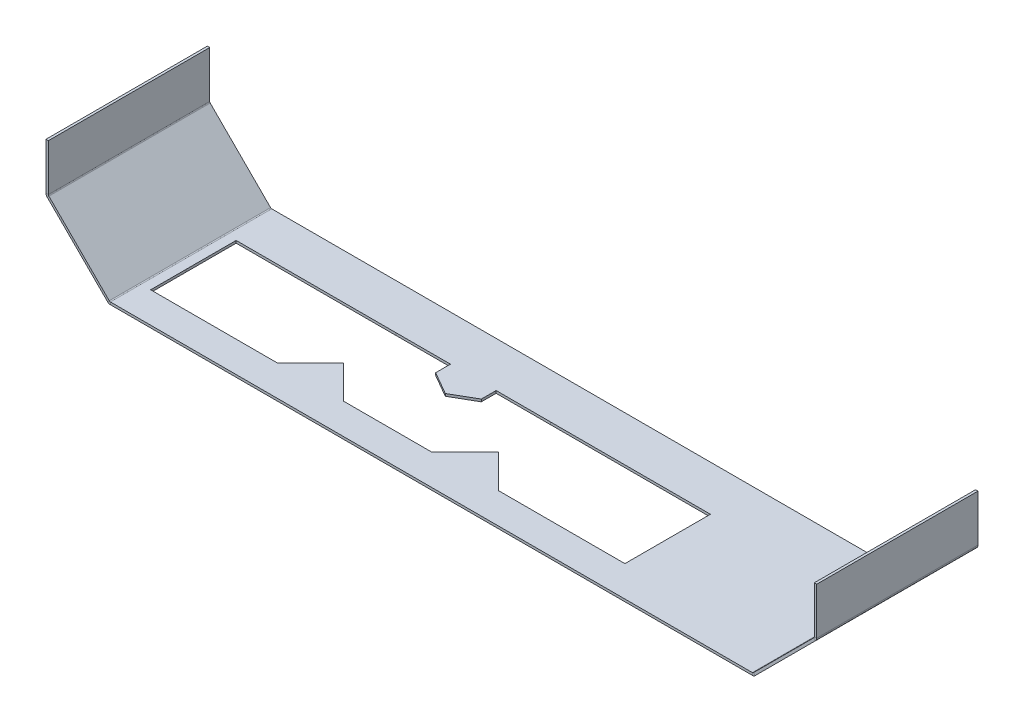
ISO-10303-21;
HEADER;
FILE_DESCRIPTION(('STEP AP214'),'2;1');
FILE_NAME('part.step','',(''),(''),'','','');
FILE_SCHEMA(('AUTOMOTIVE_DESIGN { 1 0 10303 214 1 1 1 1 }'));
ENDSEC;
DATA;
#1=APPLICATION_CONTEXT('core data for automotive mechanical design processes');
#2=APPLICATION_PROTOCOL_DEFINITION('international standard','automotive_design',2000,#1);
#3=PRODUCT_CONTEXT('',#1,'mechanical');
#4=PRODUCT('Part','Part','',(#3));
#5=PRODUCT_RELATED_PRODUCT_CATEGORY('part','',(#4));
#6=PRODUCT_DEFINITION_FORMATION('','',#4);
#7=PRODUCT_DEFINITION_CONTEXT('part definition',#1,'design');
#8=PRODUCT_DEFINITION('design','',#6,#7);
#9=PRODUCT_DEFINITION_SHAPE('','',#8);
#10=(LENGTH_UNIT() NAMED_UNIT(*) SI_UNIT(.MILLI.,.METRE.));
#11=(NAMED_UNIT(*) PLANE_ANGLE_UNIT() SI_UNIT($,.RADIAN.));
#12=(NAMED_UNIT(*) SI_UNIT($,.STERADIAN.) SOLID_ANGLE_UNIT());
#13=UNCERTAINTY_MEASURE_WITH_UNIT(LENGTH_MEASURE(1.E-05),#10,'distance_accuracy_value','');
#14=(GEOMETRIC_REPRESENTATION_CONTEXT(3) GLOBAL_UNCERTAINTY_ASSIGNED_CONTEXT((#13)) GLOBAL_UNIT_ASSIGNED_CONTEXT((#10,
#11,#12)) REPRESENTATION_CONTEXT('',''));
#15=CARTESIAN_POINT('',(0.,0.,0.));
#16=DIRECTION('',(0.,0.,1.));
#17=DIRECTION('',(1.,0.,0.));
#18=AXIS2_PLACEMENT_3D('',#15,#16,#17);
#19=CARTESIAN_POINT('',(238.158639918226,38.1586399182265,50.));
#20=DIRECTION('',(0.,0.,1.));
#21=DIRECTION('',(1.,0.,0.));
#22=AXIS2_PLACEMENT_3D('',#19,#20,#21);
#23=PLANE('',#22);
#24=DIRECTION('',(-0.707106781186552,0.707106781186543,0.));
#25=VECTOR('',#24,1.);
#26=CARTESIAN_POINT('',(238.158639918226,38.1586399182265,50.));
#27=LINE('',#26,#25);
#28=CARTESIAN_POINT('',(238.158639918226,38.1586399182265,50.));
#29=VERTEX_POINT('',#28);
#30=CARTESIAN_POINT('',(237.097979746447,39.2193000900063,50.));
#31=VERTEX_POINT('',#30);
#32=EDGE_CURVE('E599',#29,#31,#27,.T.);
#33=ORIENTED_EDGE('',*,*,#32,.F.);
#34=CARTESIAN_POINT('',(236.39087296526,39.9264068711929,50.));
#35=DIRECTION('',(0.,0.,1.));
#36=DIRECTION('',(1.,0.,0.));
#37=AXIS2_PLACEMENT_3D('',#34,#35,#36);
#38=CIRCLE('',#37,2.5);
#39=CARTESIAN_POINT('',(238.89087296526,39.9264068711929,50.));
#40=VERTEX_POINT('',#39);
#41=EDGE_CURVE('E422',#40,#29,#38,.F.);
#42=ORIENTED_EDGE('',*,*,#41,.F.);
#43=DIRECTION('',(1.,0.,0.));
#44=VECTOR('',#43,1.);
#45=CARTESIAN_POINT('',(237.39087296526,39.9264068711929,50.));
#46=LINE('',#45,#44);
#47=CARTESIAN_POINT('',(237.39087296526,39.9264068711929,50.));
#48=VERTEX_POINT('',#47);
#49=EDGE_CURVE('E597',#48,#40,#46,.T.);
#50=ORIENTED_EDGE('',*,*,#49,.F.);
#51=CARTESIAN_POINT('',(236.39087296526,39.9264068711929,50.));
#52=DIRECTION('',(0.,0.,1.));
#53=DIRECTION('',(1.,0.,0.));
#54=AXIS2_PLACEMENT_3D('',#51,#52,#53);
#55=CIRCLE('',#54,1.);
#56=EDGE_CURVE('E434',#48,#31,#55,.F.);
#57=ORIENTED_EDGE('',*,*,#56,.T.);
#58=EDGE_LOOP('',(#33,#42,#50,#57));
#59=FACE_BOUND('',#58,.T.);
#60=ADVANCED_FACE('F42',(#59),#23,.T.);
#61=CARTESIAN_POINT('',(237.39087296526,39.9264068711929,50.));
#62=DIRECTION('',(0.,0.,1.));
#63=DIRECTION('',(1.,0.,0.));
#64=AXIS2_PLACEMENT_3D('',#61,#62,#63);
#65=PLANE('',#64);
#66=DIRECTION('',(-0.707106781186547,-0.707106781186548,0.));
#67=VECTOR('',#66,1.);
#68=CARTESIAN_POINT('',(200.,0.,50.));
#69=LINE('',#68,#67);
#70=CARTESIAN_POINT('',(200.732233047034,0.732233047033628,50.));
#71=VERTEX_POINT('',#70);
#72=EDGE_CURVE('E419',#29,#71,#69,.T.);
#73=ORIENTED_EDGE('',*,*,#72,.F.);
#74=ORIENTED_EDGE('',*,*,#32,.T.);
#75=DIRECTION('',(-0.707106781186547,-0.707106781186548,0.));
#76=VECTOR('',#75,1.);
#77=CARTESIAN_POINT('',(198.93933982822,1.06066017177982,50.));
#78=LINE('',#77,#76);
#79=CARTESIAN_POINT('',(199.671572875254,1.79289321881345,50.));
#80=VERTEX_POINT('',#79);
#81=EDGE_CURVE('E437',#31,#80,#78,.T.);
#82=ORIENTED_EDGE('',*,*,#81,.T.);
#83=DIRECTION('',(0.70710678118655,-0.707106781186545,0.));
#84=VECTOR('',#83,1.);
#85=CARTESIAN_POINT('',(199.671572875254,1.79289321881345,50.));
#86=LINE('',#85,#84);
#87=EDGE_CURVE('E589',#80,#71,#86,.T.);
#88=ORIENTED_EDGE('',*,*,#87,.T.);
#89=EDGE_LOOP('',(#73,#74,#82,#88));
#90=FACE_BOUND('',#89,.T.);
#91=ADVANCED_FACE('F779',(#90),#65,.T.);
#92=CARTESIAN_POINT('',(238.89087296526,39.9264068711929,-50.));
#93=DIRECTION('',(0.,0.,-1.));
#94=DIRECTION('',(-1.,0.,0.));
#95=AXIS2_PLACEMENT_3D('',#92,#93,#94);
#96=PLANE('',#95);
#97=DIRECTION('',(-1.,0.,0.));
#98=VECTOR('',#97,1.);
#99=CARTESIAN_POINT('',(238.89087296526,39.9264068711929,-50.));
#100=LINE('',#99,#98);
#101=CARTESIAN_POINT('',(238.89087296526,39.9264068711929,-50.));
#102=VERTEX_POINT('',#101);
#103=CARTESIAN_POINT('',(237.39087296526,39.9264068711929,-50.));
#104=VERTEX_POINT('',#103);
#105=EDGE_CURVE('E595',#102,#104,#100,.T.);
#106=ORIENTED_EDGE('',*,*,#105,.F.);
#107=CARTESIAN_POINT('',(236.39087296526,39.9264068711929,-50.));
#108=DIRECTION('',(0.,0.,1.));
#109=DIRECTION('',(1.,0.,0.));
#110=AXIS2_PLACEMENT_3D('',#107,#108,#109);
#111=CIRCLE('',#110,2.5);
#112=CARTESIAN_POINT('',(238.158639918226,38.1586399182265,-50.));
#113=VERTEX_POINT('',#112);
#114=EDGE_CURVE('E482',#102,#113,#111,.F.);
#115=ORIENTED_EDGE('',*,*,#114,.T.);
#116=DIRECTION('',(0.707106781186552,-0.707106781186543,0.));
#117=VECTOR('',#116,1.);
#118=CARTESIAN_POINT('',(237.097979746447,39.2193000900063,-50.));
#119=LINE('',#118,#117);
#120=CARTESIAN_POINT('',(237.097979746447,39.2193000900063,-50.));
#121=VERTEX_POINT('',#120);
#122=EDGE_CURVE('E593',#121,#113,#119,.T.);
#123=ORIENTED_EDGE('',*,*,#122,.F.);
#124=CARTESIAN_POINT('',(236.39087296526,39.9264068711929,-50.));
#125=DIRECTION('',(0.,0.,1.));
#126=DIRECTION('',(1.,0.,0.));
#127=AXIS2_PLACEMENT_3D('',#124,#125,#126);
#128=CIRCLE('',#127,1.);
#129=EDGE_CURVE('E494',#104,#121,#128,.F.);
#130=ORIENTED_EDGE('',*,*,#129,.F.);
#131=EDGE_LOOP('',(#106,#115,#123,#130));
#132=FACE_BOUND('',#131,.T.);
#133=ADVANCED_FACE('F784',(#132),#96,.T.);
#134=CARTESIAN_POINT('',(237.097979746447,39.2193000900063,-50.));
#135=DIRECTION('',(0.,0.,-1.));
#136=DIRECTION('',(-1.,0.,0.));
#137=AXIS2_PLACEMENT_3D('',#134,#135,#136);
#138=PLANE('',#137);
#139=DIRECTION('',(0.,-1.,0.));
#140=VECTOR('',#139,1.);
#141=CARTESIAN_POINT('',(238.89087296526,38.8908729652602,-50.));
#142=LINE('',#141,#140);
#143=CARTESIAN_POINT('',(238.89087296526,68.8908729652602,-50.));
#144=VERTEX_POINT('',#143);
#145=EDGE_CURVE('E485',#144,#102,#142,.T.);
#146=ORIENTED_EDGE('',*,*,#145,.T.);
#147=ORIENTED_EDGE('',*,*,#105,.T.);
#148=DIRECTION('',(0.,1.,0.));
#149=VECTOR('',#148,1.);
#150=CARTESIAN_POINT('',(237.39087296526,38.8908729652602,-50.));
#151=LINE('',#150,#149);
#152=CARTESIAN_POINT('',(237.39087296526,68.8908729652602,-50.));
#153=VERTEX_POINT('',#152);
#154=EDGE_CURVE('E491',#153,#104,#151,.F.);
#155=ORIENTED_EDGE('',*,*,#154,.F.);
#156=DIRECTION('',(1.,0.,0.));
#157=VECTOR('',#156,1.);
#158=CARTESIAN_POINT('',(237.39087296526,68.8908729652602,-50.));
#159=LINE('',#158,#157);
#160=EDGE_CURVE('E488',#153,#144,#159,.T.);
#161=ORIENTED_EDGE('',*,*,#160,.T.);
#162=EDGE_LOOP('',(#146,#147,#155,#161));
#163=FACE_BOUND('',#162,.T.);
#164=ADVANCED_FACE('F841',(#163),#138,.T.);
#165=CARTESIAN_POINT('',(198.964466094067,0.,50.));
#166=DIRECTION('',(0.,0.,1.));
#167=DIRECTION('',(1.,0.,0.));
#168=AXIS2_PLACEMENT_3D('',#165,#166,#167);
#169=PLANE('',#168);
#170=DIRECTION('',(0.,1.,0.));
#171=VECTOR('',#170,1.);
#172=CARTESIAN_POINT('',(198.964466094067,0.,50.));
#173=LINE('',#172,#171);
#174=CARTESIAN_POINT('',(198.964466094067,0.,50.));
#175=VERTEX_POINT('',#174);
#176=CARTESIAN_POINT('',(198.964466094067,1.5,50.));
#177=VERTEX_POINT('',#176);
#178=EDGE_CURVE('E591',#175,#177,#173,.T.);
#179=ORIENTED_EDGE('',*,*,#178,.F.);
#180=CARTESIAN_POINT('',(198.964466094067,2.5,50.));
#181=DIRECTION('',(0.,0.,1.));
#182=DIRECTION('',(1.,0.,0.));
#183=AXIS2_PLACEMENT_3D('',#180,#181,#182);
#184=CIRCLE('',#183,2.5);
#185=EDGE_CURVE('E416',#71,#175,#184,.F.);
#186=ORIENTED_EDGE('',*,*,#185,.F.);
#187=ORIENTED_EDGE('',*,*,#87,.F.);
#188=CARTESIAN_POINT('',(198.964466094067,2.5,50.));
#189=DIRECTION('',(0.,0.,1.));
#190=DIRECTION('',(1.,0.,0.));
#191=AXIS2_PLACEMENT_3D('',#188,#189,#190);
#192=CIRCLE('',#191,1.);
#193=EDGE_CURVE('E440',#80,#177,#192,.F.);
#194=ORIENTED_EDGE('',*,*,#193,.T.);
#195=EDGE_LOOP('',(#179,#186,#187,#194));
#196=FACE_BOUND('',#195,.T.);
#197=ADVANCED_FACE('F829',(#196),#169,.T.);
#198=CARTESIAN_POINT('',(199.671572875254,1.79289321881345,50.));
#199=DIRECTION('',(0.,0.,1.));
#200=DIRECTION('',(1.,0.,0.));
#201=AXIS2_PLACEMENT_3D('',#198,#199,#200);
#202=PLANE('',#201);
#203=DIRECTION('',(-1.,0.,0.));
#204=VECTOR('',#203,1.);
#205=CARTESIAN_POINT('',(-200.,0.,50.));
#206=LINE('',#205,#204);
#207=CARTESIAN_POINT('',(-198.964466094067,0.,50.));
#208=VERTEX_POINT('',#207);
#209=EDGE_CURVE('E413',#175,#208,#206,.T.);
#210=ORIENTED_EDGE('',*,*,#209,.F.);
#211=ORIENTED_EDGE('',*,*,#178,.T.);
#212=DIRECTION('',(1.,0.,0.));
#213=VECTOR('',#212,1.);
#214=CARTESIAN_POINT('',(-200.,1.5,50.));
#215=LINE('',#214,#213);
#216=CARTESIAN_POINT('',(-198.964466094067,1.5,50.));
#217=VERTEX_POINT('',#216);
#218=EDGE_CURVE('E443',#177,#217,#215,.F.);
#219=ORIENTED_EDGE('',*,*,#218,.T.);
#220=DIRECTION('',(0.,-1.,0.));
#221=VECTOR('',#220,1.);
#222=CARTESIAN_POINT('',(-198.964466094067,1.5,50.));
#223=LINE('',#222,#221);
#224=EDGE_CURVE('E581',#217,#208,#223,.T.);
#225=ORIENTED_EDGE('',*,*,#224,.T.);
#226=EDGE_LOOP('',(#210,#211,#219,#225));
#227=FACE_BOUND('',#226,.T.);
#228=ADVANCED_FACE('F848',(#227),#202,.T.);
#229=CARTESIAN_POINT('',(200.732233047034,0.732233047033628,-50.));
#230=DIRECTION('',(0.,0.,-1.));
#231=DIRECTION('',(-1.,0.,0.));
#232=AXIS2_PLACEMENT_3D('',#229,#230,#231);
#233=PLANE('',#232);
#234=DIRECTION('',(-0.70710678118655,0.707106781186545,0.));
#235=VECTOR('',#234,1.);
#236=CARTESIAN_POINT('',(200.732233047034,0.732233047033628,-50.));
#237=LINE('',#236,#235);
#238=CARTESIAN_POINT('',(200.732233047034,0.732233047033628,-50.));
#239=VERTEX_POINT('',#238);
#240=CARTESIAN_POINT('',(199.671572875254,1.79289321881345,-50.));
#241=VERTEX_POINT('',#240);
#242=EDGE_CURVE('E587',#239,#241,#237,.T.);
#243=ORIENTED_EDGE('',*,*,#242,.F.);
#244=CARTESIAN_POINT('',(198.964466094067,2.5,-50.));
#245=DIRECTION('',(0.,0.,1.));
#246=DIRECTION('',(1.,0.,0.));
#247=AXIS2_PLACEMENT_3D('',#244,#245,#246);
#248=CIRCLE('',#247,2.5);
#249=CARTESIAN_POINT('',(198.964466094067,0.,-50.));
#250=VERTEX_POINT('',#249);
#251=EDGE_CURVE('E476',#239,#250,#248,.F.);
#252=ORIENTED_EDGE('',*,*,#251,.T.);
#253=DIRECTION('',(0.,-1.,0.));
#254=VECTOR('',#253,1.);
#255=CARTESIAN_POINT('',(198.964466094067,1.5,-50.));
#256=LINE('',#255,#254);
#257=CARTESIAN_POINT('',(198.964466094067,1.5,-50.));
#258=VERTEX_POINT('',#257);
#259=EDGE_CURVE('E585',#258,#250,#256,.T.);
#260=ORIENTED_EDGE('',*,*,#259,.F.);
#261=CARTESIAN_POINT('',(198.964466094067,2.5,-50.));
#262=DIRECTION('',(0.,0.,1.));
#263=DIRECTION('',(1.,0.,0.));
#264=AXIS2_PLACEMENT_3D('',#261,#262,#263);
#265=CIRCLE('',#264,1.);
#266=EDGE_CURVE('E500',#241,#258,#265,.F.);
#267=ORIENTED_EDGE('',*,*,#266,.F.);
#268=EDGE_LOOP('',(#243,#252,#260,#267));
#269=FACE_BOUND('',#268,.T.);
#270=ADVANCED_FACE('F854',(#269),#233,.T.);
#271=CARTESIAN_POINT('',(198.964466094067,1.5,-50.));
#272=DIRECTION('',(0.,0.,-1.));
#273=DIRECTION('',(-1.,0.,0.));
#274=AXIS2_PLACEMENT_3D('',#271,#272,#273);
#275=PLANE('',#274);
#276=DIRECTION('',(-0.707106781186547,-0.707106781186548,0.));
#277=VECTOR('',#276,1.);
#278=CARTESIAN_POINT('',(200.,0.,-50.));
#279=LINE('',#278,#277);
#280=EDGE_CURVE('E479',#113,#239,#279,.T.);
#281=ORIENTED_EDGE('',*,*,#280,.T.);
#282=ORIENTED_EDGE('',*,*,#242,.T.);
#283=DIRECTION('',(-0.707106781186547,-0.707106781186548,0.));
#284=VECTOR('',#283,1.);
#285=CARTESIAN_POINT('',(198.93933982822,1.06066017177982,-50.));
#286=LINE('',#285,#284);
#287=EDGE_CURVE('E497',#121,#241,#286,.T.);
#288=ORIENTED_EDGE('',*,*,#287,.F.);
#289=ORIENTED_EDGE('',*,*,#122,.T.);
#290=EDGE_LOOP('',(#281,#282,#288,#289));
#291=FACE_BOUND('',#290,.T.);
#292=ADVANCED_FACE('F838',(#291),#275,.T.);
#293=CARTESIAN_POINT('',(-200.732233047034,0.732233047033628,50.));
#294=DIRECTION('',(0.,0.,1.));
#295=DIRECTION('',(1.,0.,0.));
#296=AXIS2_PLACEMENT_3D('',#293,#294,#295);
#297=PLANE('',#296);
#298=DIRECTION('',(0.707106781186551,0.707106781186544,0.));
#299=VECTOR('',#298,1.);
#300=CARTESIAN_POINT('',(-200.732233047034,0.732233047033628,50.));
#301=LINE('',#300,#299);
#302=CARTESIAN_POINT('',(-200.732233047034,0.732233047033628,50.));
#303=VERTEX_POINT('',#302);
#304=CARTESIAN_POINT('',(-199.671572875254,1.79289321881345,50.));
#305=VERTEX_POINT('',#304);
#306=EDGE_CURVE('E583',#303,#305,#301,.T.);
#307=ORIENTED_EDGE('',*,*,#306,.F.);
#308=CARTESIAN_POINT('',(-198.964466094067,2.5,50.));
#309=DIRECTION('',(0.,0.,1.));
#310=DIRECTION('',(1.,0.,0.));
#311=AXIS2_PLACEMENT_3D('',#308,#309,#310);
#312=CIRCLE('',#311,2.5);
#313=EDGE_CURVE('E410',#208,#303,#312,.F.);
#314=ORIENTED_EDGE('',*,*,#313,.F.);
#315=ORIENTED_EDGE('',*,*,#224,.F.);
#316=CARTESIAN_POINT('',(-198.964466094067,2.5,50.));
#317=DIRECTION('',(0.,0.,1.));
#318=DIRECTION('',(1.,0.,0.));
#319=AXIS2_PLACEMENT_3D('',#316,#317,#318);
#320=CIRCLE('',#319,1.);
#321=EDGE_CURVE('E446',#217,#305,#320,.F.);
#322=ORIENTED_EDGE('',*,*,#321,.T.);
#323=EDGE_LOOP('',(#307,#314,#315,#322));
#324=FACE_BOUND('',#323,.T.);
#325=ADVANCED_FACE('F860',(#324),#297,.T.);
#326=CARTESIAN_POINT('',(-198.964466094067,1.5,50.));
#327=DIRECTION('',(0.,0.,1.));
#328=DIRECTION('',(1.,0.,0.));
#329=AXIS2_PLACEMENT_3D('',#326,#327,#328);
#330=PLANE('',#329);
#331=DIRECTION('',(-0.707106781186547,0.707106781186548,0.));
#332=VECTOR('',#331,1.);
#333=CARTESIAN_POINT('',(-200.,0.,50.));
#334=LINE('',#333,#332);
#335=CARTESIAN_POINT('',(-238.158639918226,38.1586399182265,50.));
#336=VERTEX_POINT('',#335);
#337=EDGE_CURVE('E407',#303,#336,#334,.T.);
#338=ORIENTED_EDGE('',*,*,#337,.F.);
#339=ORIENTED_EDGE('',*,*,#306,.T.);
#340=DIRECTION('',(-0.707106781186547,0.707106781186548,0.));
#341=VECTOR('',#340,1.);
#342=CARTESIAN_POINT('',(-198.93933982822,1.06066017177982,50.));
#343=LINE('',#342,#341);
#344=CARTESIAN_POINT('',(-237.097979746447,39.2193000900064,50.));
#345=VERTEX_POINT('',#344);
#346=EDGE_CURVE('E449',#305,#345,#343,.T.);
#347=ORIENTED_EDGE('',*,*,#346,.T.);
#348=DIRECTION('',(-0.70710678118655,-0.707106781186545,0.));
#349=VECTOR('',#348,1.);
#350=CARTESIAN_POINT('',(-237.097979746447,39.2193000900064,50.));
#351=LINE('',#350,#349);
#352=EDGE_CURVE('E573',#345,#336,#351,.T.);
#353=ORIENTED_EDGE('',*,*,#352,.T.);
#354=EDGE_LOOP('',(#338,#339,#347,#353));
#355=FACE_BOUND('',#354,.T.);
#356=ADVANCED_FACE('F863',(#355),#330,.T.);
#357=CARTESIAN_POINT('',(-198.964466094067,0.,-50.));
#358=DIRECTION('',(0.,0.,-1.));
#359=DIRECTION('',(-1.,0.,0.));
#360=AXIS2_PLACEMENT_3D('',#357,#358,#359);
#361=PLANE('',#360);
#362=DIRECTION('',(0.,1.,0.));
#363=VECTOR('',#362,1.);
#364=CARTESIAN_POINT('',(-198.964466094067,0.,-50.));
#365=LINE('',#364,#363);
#366=CARTESIAN_POINT('',(-198.964466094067,0.,-50.));
#367=VERTEX_POINT('',#366);
#368=CARTESIAN_POINT('',(-198.964466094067,1.5,-50.));
#369=VERTEX_POINT('',#368);
#370=EDGE_CURVE('E579',#367,#369,#365,.T.);
#371=ORIENTED_EDGE('',*,*,#370,.F.);
#372=CARTESIAN_POINT('',(-198.964466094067,2.5,-50.));
#373=DIRECTION('',(0.,0.,1.));
#374=DIRECTION('',(1.,0.,0.));
#375=AXIS2_PLACEMENT_3D('',#372,#373,#374);
#376=CIRCLE('',#375,2.5);
#377=CARTESIAN_POINT('',(-200.732233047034,0.732233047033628,-50.));
#378=VERTEX_POINT('',#377);
#379=EDGE_CURVE('E470',#367,#378,#376,.F.);
#380=ORIENTED_EDGE('',*,*,#379,.T.);
#381=DIRECTION('',(-0.707106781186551,-0.707106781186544,0.));
#382=VECTOR('',#381,1.);
#383=CARTESIAN_POINT('',(-199.671572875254,1.79289321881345,-50.));
#384=LINE('',#383,#382);
#385=CARTESIAN_POINT('',(-199.671572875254,1.79289321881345,-50.));
#386=VERTEX_POINT('',#385);
#387=EDGE_CURVE('E577',#386,#378,#384,.T.);
#388=ORIENTED_EDGE('',*,*,#387,.F.);
#389=CARTESIAN_POINT('',(-198.964466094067,2.5,-50.));
#390=DIRECTION('',(0.,0.,1.));
#391=DIRECTION('',(1.,0.,0.));
#392=AXIS2_PLACEMENT_3D('',#389,#390,#391);
#393=CIRCLE('',#392,1.);
#394=EDGE_CURVE('E506',#369,#386,#393,.F.);
#395=ORIENTED_EDGE('',*,*,#394,.F.);
#396=EDGE_LOOP('',(#371,#380,#388,#395));
#397=FACE_BOUND('',#396,.T.);
#398=ADVANCED_FACE('F867',(#397),#361,.T.);
#399=CARTESIAN_POINT('',(-199.671572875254,1.79289321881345,-50.));
#400=DIRECTION('',(0.,0.,-1.));
#401=DIRECTION('',(-1.,0.,0.));
#402=AXIS2_PLACEMENT_3D('',#399,#400,#401);
#403=PLANE('',#402);
#404=DIRECTION('',(-1.,0.,0.));
#405=VECTOR('',#404,1.);
#406=CARTESIAN_POINT('',(-200.,0.,-50.));
#407=LINE('',#406,#405);
#408=EDGE_CURVE('E473',#250,#367,#407,.T.);
#409=ORIENTED_EDGE('',*,*,#408,.T.);
#410=ORIENTED_EDGE('',*,*,#370,.T.);
#411=DIRECTION('',(1.,0.,0.));
#412=VECTOR('',#411,1.);
#413=CARTESIAN_POINT('',(-200.,1.5,-50.));
#414=LINE('',#413,#412);
#415=EDGE_CURVE('E503',#258,#369,#414,.F.);
#416=ORIENTED_EDGE('',*,*,#415,.F.);
#417=ORIENTED_EDGE('',*,*,#259,.T.);
#418=EDGE_LOOP('',(#409,#410,#416,#417));
#419=FACE_BOUND('',#418,.T.);
#420=ADVANCED_FACE('F871',(#419),#403,.T.);
#421=CARTESIAN_POINT('',(-238.89087296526,39.9264068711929,50.));
#422=DIRECTION('',(0.,0.,1.));
#423=DIRECTION('',(1.,0.,0.));
#424=AXIS2_PLACEMENT_3D('',#421,#422,#423);
#425=PLANE('',#424);
#426=DIRECTION('',(1.,0.,0.));
#427=VECTOR('',#426,1.);
#428=CARTESIAN_POINT('',(-238.89087296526,39.9264068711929,50.));
#429=LINE('',#428,#427);
#430=CARTESIAN_POINT('',(-238.89087296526,39.9264068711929,50.));
#431=VERTEX_POINT('',#430);
#432=CARTESIAN_POINT('',(-237.39087296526,39.9264068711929,50.));
#433=VERTEX_POINT('',#432);
#434=EDGE_CURVE('E575',#431,#433,#429,.T.);
#435=ORIENTED_EDGE('',*,*,#434,.F.);
#436=CARTESIAN_POINT('',(-236.39087296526,39.9264068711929,50.));
#437=DIRECTION('',(0.,0.,1.));
#438=DIRECTION('',(1.,0.,0.));
#439=AXIS2_PLACEMENT_3D('',#436,#437,#438);
#440=CIRCLE('',#439,2.5);
#441=EDGE_CURVE('E404',#336,#431,#440,.F.);
#442=ORIENTED_EDGE('',*,*,#441,.F.);
#443=ORIENTED_EDGE('',*,*,#352,.F.);
#444=CARTESIAN_POINT('',(-236.39087296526,39.9264068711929,50.));
#445=DIRECTION('',(0.,0.,1.));
#446=DIRECTION('',(1.,0.,0.));
#447=AXIS2_PLACEMENT_3D('',#444,#445,#446);
#448=CIRCLE('',#447,1.);
#449=EDGE_CURVE('E452',#345,#433,#448,.F.);
#450=ORIENTED_EDGE('',*,*,#449,.T.);
#451=EDGE_LOOP('',(#435,#442,#443,#450));
#452=FACE_BOUND('',#451,.T.);
#453=ADVANCED_FACE('F875',(#452),#425,.T.);
#454=CARTESIAN_POINT('',(-237.097979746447,39.2193000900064,50.));
#455=DIRECTION('',(0.,0.,1.));
#456=DIRECTION('',(1.,0.,0.));
#457=AXIS2_PLACEMENT_3D('',#454,#455,#456);
#458=PLANE('',#457);
#459=DIRECTION('',(0.,1.,0.));
#460=VECTOR('',#459,1.);
#461=CARTESIAN_POINT('',(-238.89087296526,38.8908729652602,50.));
#462=LINE('',#461,#460);
#463=CARTESIAN_POINT('',(-238.89087296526,68.8908729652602,50.));
#464=VERTEX_POINT('',#463);
#465=EDGE_CURVE('E401',#431,#464,#462,.T.);
#466=ORIENTED_EDGE('',*,*,#465,.F.);
#467=ORIENTED_EDGE('',*,*,#434,.T.);
#468=DIRECTION('',(0.,1.,0.));
#469=VECTOR('',#468,1.);
#470=CARTESIAN_POINT('',(-237.39087296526,38.8908729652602,50.));
#471=LINE('',#470,#469);
#472=CARTESIAN_POINT('',(-237.39087296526,68.8908729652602,50.));
#473=VERTEX_POINT('',#472);
#474=EDGE_CURVE('E395',#433,#473,#471,.T.);
#475=ORIENTED_EDGE('',*,*,#474,.T.);
#476=DIRECTION('',(1.,0.,0.));
#477=VECTOR('',#476,1.);
#478=CARTESIAN_POINT('',(-238.89087296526,68.8908729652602,50.));
#479=LINE('',#478,#477);
#480=EDGE_CURVE('E397',#464,#473,#479,.T.);
#481=ORIENTED_EDGE('',*,*,#480,.F.);
#482=EDGE_LOOP('',(#466,#467,#475,#481));
#483=FACE_BOUND('',#482,.T.);
#484=ADVANCED_FACE('F879',(#483),#458,.T.);
#485=CARTESIAN_POINT('',(-238.158639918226,38.1586399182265,-50.));
#486=DIRECTION('',(0.,0.,-1.));
#487=DIRECTION('',(-1.,0.,0.));
#488=AXIS2_PLACEMENT_3D('',#485,#486,#487);
#489=PLANE('',#488);
#490=DIRECTION('',(0.70710678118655,0.707106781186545,0.));
#491=VECTOR('',#490,1.);
#492=CARTESIAN_POINT('',(-238.158639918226,38.1586399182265,-50.));
#493=LINE('',#492,#491);
#494=CARTESIAN_POINT('',(-238.158639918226,38.1586399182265,-50.));
#495=VERTEX_POINT('',#494);
#496=CARTESIAN_POINT('',(-237.097979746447,39.2193000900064,-50.));
#497=VERTEX_POINT('',#496);
#498=EDGE_CURVE('E571',#495,#497,#493,.T.);
#499=ORIENTED_EDGE('',*,*,#498,.F.);
#500=CARTESIAN_POINT('',(-236.39087296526,39.9264068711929,-50.));
#501=DIRECTION('',(0.,0.,1.));
#502=DIRECTION('',(1.,0.,0.));
#503=AXIS2_PLACEMENT_3D('',#500,#501,#502);
#504=CIRCLE('',#503,2.5);
#505=CARTESIAN_POINT('',(-238.89087296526,39.9264068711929,-50.));
#506=VERTEX_POINT('',#505);
#507=EDGE_CURVE('E464',#495,#506,#504,.F.);
#508=ORIENTED_EDGE('',*,*,#507,.T.);
#509=DIRECTION('',(-1.,0.,0.));
#510=VECTOR('',#509,1.);
#511=CARTESIAN_POINT('',(-237.39087296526,39.9264068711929,-50.));
#512=LINE('',#511,#510);
#513=CARTESIAN_POINT('',(-237.39087296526,39.9264068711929,-50.));
#514=VERTEX_POINT('',#513);
#515=EDGE_CURVE('E569',#514,#506,#512,.T.);
#516=ORIENTED_EDGE('',*,*,#515,.F.);
#517=CARTESIAN_POINT('',(-236.39087296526,39.9264068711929,-50.));
#518=DIRECTION('',(0.,0.,1.));
#519=DIRECTION('',(1.,0.,0.));
#520=AXIS2_PLACEMENT_3D('',#517,#518,#519);
#521=CIRCLE('',#520,1.);
#522=EDGE_CURVE('E398',#497,#514,#521,.F.);
#523=ORIENTED_EDGE('',*,*,#522,.F.);
#524=EDGE_LOOP('',(#499,#508,#516,#523));
#525=FACE_BOUND('',#524,.T.);
#526=ADVANCED_FACE('F883',(#525),#489,.T.);
#527=CARTESIAN_POINT('',(-237.39087296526,39.9264068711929,-50.));
#528=DIRECTION('',(0.,0.,-1.));
#529=DIRECTION('',(-1.,0.,0.));
#530=AXIS2_PLACEMENT_3D('',#527,#528,#529);
#531=PLANE('',#530);
#532=DIRECTION('',(-0.707106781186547,0.707106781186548,0.));
#533=VECTOR('',#532,1.);
#534=CARTESIAN_POINT('',(-200.,0.,-50.));
#535=LINE('',#534,#533);
#536=EDGE_CURVE('E467',#378,#495,#535,.T.);
#537=ORIENTED_EDGE('',*,*,#536,.T.);
#538=ORIENTED_EDGE('',*,*,#498,.T.);
#539=DIRECTION('',(-0.707106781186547,0.707106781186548,0.));
#540=VECTOR('',#539,1.);
#541=CARTESIAN_POINT('',(-198.93933982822,1.06066017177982,-50.));
#542=LINE('',#541,#540);
#543=EDGE_CURVE('E509',#386,#497,#542,.T.);
#544=ORIENTED_EDGE('',*,*,#543,.F.);
#545=ORIENTED_EDGE('',*,*,#387,.T.);
#546=EDGE_LOOP('',(#537,#538,#544,#545));
#547=FACE_BOUND('',#546,.T.);
#548=ADVANCED_FACE('F887',(#547),#531,.T.);
#549=CARTESIAN_POINT('',(-237.39087296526,38.8908729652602,50.));
#550=DIRECTION('',(-1.,0.,0.));
#551=DIRECTION('',(0.,0.,1.));
#552=AXIS2_PLACEMENT_3D('',#549,#550,#551);
#553=PLANE('',#552);
#554=DIRECTION('',(0.,1.,0.));
#555=VECTOR('',#554,1.);
#556=CARTESIAN_POINT('',(-237.39087296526,38.8908729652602,-50.));
#557=LINE('',#556,#555);
#558=CARTESIAN_POINT('',(-237.39087296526,68.8908729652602,-50.));
#559=VERTEX_POINT('',#558);
#560=EDGE_CURVE('E394',#514,#559,#557,.T.);
#561=ORIENTED_EDGE('',*,*,#560,.T.);
#562=DIRECTION('',(0.,0.,-1.));
#563=VECTOR('',#562,1.);
#564=CARTESIAN_POINT('',(-237.39087296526,68.8908729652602,50.));
#565=LINE('',#564,#563);
#566=EDGE_CURVE('E567',#473,#559,#565,.T.);
#567=ORIENTED_EDGE('',*,*,#566,.F.);
#568=ORIENTED_EDGE('',*,*,#474,.F.);
#569=DIRECTION('',(0.,0.,-1.));
#570=VECTOR('',#569,1.);
#571=CARTESIAN_POINT('',(-237.39087296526,39.9264068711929,50.));
#572=LINE('',#571,#570);
#573=EDGE_CURVE('E455',#433,#514,#572,.T.);
#574=ORIENTED_EDGE('',*,*,#573,.T.);
#575=EDGE_LOOP('',(#561,#567,#568,#574));
#576=FACE_BOUND('',#575,.T.);
#577=ADVANCED_FACE('F891',(#576),#553,.F.);
#578=CARTESIAN_POINT('',(-238.89087296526,68.8908729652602,50.));
#579=DIRECTION('',(0.,1.,0.));
#580=DIRECTION('',(0.,0.,1.));
#581=AXIS2_PLACEMENT_3D('',#578,#579,#580);
#582=PLANE('',#581);
#583=DIRECTION('',(1.,0.,0.));
#584=VECTOR('',#583,1.);
#585=CARTESIAN_POINT('',(-238.89087296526,68.8908729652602,-50.));
#586=LINE('',#585,#584);
#587=CARTESIAN_POINT('',(-238.89087296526,68.8908729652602,-50.));
#588=VERTEX_POINT('',#587);
#589=EDGE_CURVE('E458',#588,#559,#586,.T.);
#590=ORIENTED_EDGE('',*,*,#589,.F.);
#591=DIRECTION('',(0.,0.,-1.));
#592=VECTOR('',#591,1.);
#593=CARTESIAN_POINT('',(-238.89087296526,68.8908729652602,50.));
#594=LINE('',#593,#592);
#595=EDGE_CURVE('E565',#464,#588,#594,.T.);
#596=ORIENTED_EDGE('',*,*,#595,.F.);
#597=ORIENTED_EDGE('',*,*,#480,.T.);
#598=ORIENTED_EDGE('',*,*,#566,.T.);
#599=EDGE_LOOP('',(#590,#596,#597,#598));
#600=FACE_BOUND('',#599,.T.);
#601=ADVANCED_FACE('F895',(#600),#582,.T.);
#602=CARTESIAN_POINT('',(-238.89087296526,38.8908729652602,50.));
#603=DIRECTION('',(-1.,0.,0.));
#604=DIRECTION('',(0.,0.,1.));
#605=AXIS2_PLACEMENT_3D('',#602,#603,#604);
#606=PLANE('',#605);
#607=DIRECTION('',(0.,1.,0.));
#608=VECTOR('',#607,1.);
#609=CARTESIAN_POINT('',(-238.89087296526,38.8908729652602,-50.));
#610=LINE('',#609,#608);
#611=EDGE_CURVE('E461',#506,#588,#610,.T.);
#612=ORIENTED_EDGE('',*,*,#611,.F.);
#613=DIRECTION('',(0.,0.,-1.));
#614=VECTOR('',#613,1.);
#615=CARTESIAN_POINT('',(-238.89087296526,39.9264068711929,50.));
#616=LINE('',#615,#614);
#617=EDGE_CURVE('E562',#431,#506,#616,.T.);
#618=ORIENTED_EDGE('',*,*,#617,.F.);
#619=ORIENTED_EDGE('',*,*,#465,.T.);
#620=ORIENTED_EDGE('',*,*,#595,.T.);
#621=EDGE_LOOP('',(#612,#618,#619,#620));
#622=FACE_BOUND('',#621,.T.);
#623=ADVANCED_FACE('F899',(#622),#606,.T.);
#624=CARTESIAN_POINT('',(-236.39087296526,39.9264068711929,50.));
#625=DIRECTION('',(0.,0.,-1.));
#626=DIRECTION('',(-1.,0.,0.));
#627=AXIS2_PLACEMENT_3D('',#624,#625,#626);
#628=CYLINDRICAL_SURFACE('',#627,2.5);
#629=ORIENTED_EDGE('',*,*,#507,.F.);
#630=DIRECTION('',(0.,0.,-1.));
#631=VECTOR('',#630,1.);
#632=CARTESIAN_POINT('',(-238.158639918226,38.1586399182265,50.));
#633=LINE('',#632,#631);
#634=EDGE_CURVE('E559',#336,#495,#633,.T.);
#635=ORIENTED_EDGE('',*,*,#634,.F.);
#636=ORIENTED_EDGE('',*,*,#441,.T.);
#637=ORIENTED_EDGE('',*,*,#617,.T.);
#638=EDGE_LOOP('',(#629,#635,#636,#637));
#639=FACE_BOUND('',#638,.T.);
#640=ADVANCED_FACE('F903',(#639),#628,.T.);
#641=CARTESIAN_POINT('',(-200.,0.,50.));
#642=DIRECTION('',(-0.707106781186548,-0.707106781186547,0.));
#643=DIRECTION('',(0.707106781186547,-0.707106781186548,0.));
#644=AXIS2_PLACEMENT_3D('',#641,#642,#643);
#645=PLANE('',#644);
#646=ORIENTED_EDGE('',*,*,#536,.F.);
#647=DIRECTION('',(0.,0.,-1.));
#648=VECTOR('',#647,1.);
#649=CARTESIAN_POINT('',(-200.732233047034,0.732233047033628,50.));
#650=LINE('',#649,#648);
#651=EDGE_CURVE('E556',#303,#378,#650,.T.);
#652=ORIENTED_EDGE('',*,*,#651,.F.);
#653=ORIENTED_EDGE('',*,*,#337,.T.);
#654=ORIENTED_EDGE('',*,*,#634,.T.);
#655=EDGE_LOOP('',(#646,#652,#653,#654));
#656=FACE_BOUND('',#655,.T.);
#657=ADVANCED_FACE('F907',(#656),#645,.T.);
#658=CARTESIAN_POINT('',(-198.964466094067,2.5,50.));
#659=DIRECTION('',(0.,0.,-1.));
#660=DIRECTION('',(-1.,0.,0.));
#661=AXIS2_PLACEMENT_3D('',#658,#659,#660);
#662=CYLINDRICAL_SURFACE('',#661,2.5);
#663=ORIENTED_EDGE('',*,*,#379,.F.);
#664=DIRECTION('',(0.,0.,-1.));
#665=VECTOR('',#664,1.);
#666=CARTESIAN_POINT('',(-198.964466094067,0.,50.));
#667=LINE('',#666,#665);
#668=EDGE_CURVE('E553',#208,#367,#667,.T.);
#669=ORIENTED_EDGE('',*,*,#668,.F.);
#670=ORIENTED_EDGE('',*,*,#313,.T.);
#671=ORIENTED_EDGE('',*,*,#651,.T.);
#672=EDGE_LOOP('',(#663,#669,#670,#671));
#673=FACE_BOUND('',#672,.T.);
#674=ADVANCED_FACE('F911',(#673),#662,.T.);
#675=CARTESIAN_POINT('',(-200.,0.,50.));
#676=DIRECTION('',(0.,-1.,0.));
#677=DIRECTION('',(0.,0.,-1.));
#678=AXIS2_PLACEMENT_3D('',#675,#676,#677);
#679=PLANE('',#678);
#680=DIRECTION('',(0.,0.,-1.));
#681=VECTOR('',#680,1.);
#682=CARTESIAN_POINT('',(-193.02,0.,50.));
#683=LINE('',#682,#681);
#684=CARTESIAN_POINT('',(-193.02,0.,8.99999999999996));
#685=VERTEX_POINT('',#684);
#686=CARTESIAN_POINT('',(-193.02,0.,8.98999999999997));
#687=VERTEX_POINT('',#686);
#688=EDGE_CURVE('E361',#685,#687,#683,.T.);
#689=ORIENTED_EDGE('',*,*,#688,.F.);
#690=DIRECTION('',(0.,0.,1.));
#691=VECTOR('',#690,1.);
#692=CARTESIAN_POINT('',(-193.02,0.,50.));
#693=LINE('',#692,#691);
#694=CARTESIAN_POINT('',(-193.02,0.,31.));
#695=VERTEX_POINT('',#694);
#696=EDGE_CURVE('E366',#685,#695,#693,.T.);
#697=ORIENTED_EDGE('',*,*,#696,.T.);
#698=DIRECTION('',(1.,0.,0.));
#699=VECTOR('',#698,1.);
#700=CARTESIAN_POINT('',(-200.,0.,31.));
#701=LINE('',#700,#699);
#702=CARTESIAN_POINT('',(-114.676497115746,0.,31.));
#703=VERTEX_POINT('',#702);
#704=EDGE_CURVE('E363',#695,#703,#701,.T.);
#705=ORIENTED_EDGE('',*,*,#704,.T.);
#706=DIRECTION('',(-0.70710678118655,0.,0.707106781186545));
#707=VECTOR('',#706,1.);
#708=CARTESIAN_POINT('',(-166.838248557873,0.,83.1617514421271));
#709=LINE('',#708,#707);
#710=CARTESIAN_POINT('',(-94.015,0.,10.3385028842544));
#711=VERTEX_POINT('',#710);
#712=EDGE_CURVE('E359',#711,#703,#709,.T.);
#713=ORIENTED_EDGE('',*,*,#712,.F.);
#714=DIRECTION('',(-0.70710678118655,0.,-0.707106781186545));
#715=VECTOR('',#714,1.);
#716=CARTESIAN_POINT('',(-127.176751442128,0.,-22.8232485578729));
#717=LINE('',#716,#715);
#718=CARTESIAN_POINT('',(-73.3535028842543,0.,31.));
#719=VERTEX_POINT('',#718);
#720=EDGE_CURVE('E373',#719,#711,#717,.T.);
#721=ORIENTED_EDGE('',*,*,#720,.F.);
#722=DIRECTION('',(1.,0.,0.));
#723=VECTOR('',#722,1.);
#724=CARTESIAN_POINT('',(-200.,0.,31.));
#725=LINE('',#724,#723);
#726=CARTESIAN_POINT('',(-18.6664971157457,0.,31.));
#727=VERTEX_POINT('',#726);
#728=EDGE_CURVE('E375',#719,#727,#725,.T.);
#729=ORIENTED_EDGE('',*,*,#728,.T.);
#730=DIRECTION('',(-0.70710678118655,0.,0.707106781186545));
#731=VECTOR('',#730,1.);
#732=CARTESIAN_POINT('',(-118.833248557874,0.,131.166751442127));
#733=LINE('',#732,#731);
#734=CARTESIAN_POINT('',(1.99500000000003,0.,10.3385028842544));
#735=VERTEX_POINT('',#734);
#736=EDGE_CURVE('E371',#735,#727,#733,.T.);
#737=ORIENTED_EDGE('',*,*,#736,.F.);
#738=DIRECTION('',(-0.70710678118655,0.,-0.707106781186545));
#739=VECTOR('',#738,1.);
#740=CARTESIAN_POINT('',(-79.1717514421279,0.,-70.828248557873));
#741=LINE('',#740,#739);
#742=CARTESIAN_POINT('',(22.6564971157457,0.,31.));
#743=VERTEX_POINT('',#742);
#744=EDGE_CURVE('E337',#743,#735,#741,.T.);
#745=ORIENTED_EDGE('',*,*,#744,.F.);
#746=DIRECTION('',(1.,0.,0.));
#747=VECTOR('',#746,1.);
#748=CARTESIAN_POINT('',(-200.,0.,31.));
#749=LINE('',#748,#747);
#750=CARTESIAN_POINT('',(101.,0.,31.));
#751=VERTEX_POINT('',#750);
#752=EDGE_CURVE('E733',#743,#751,#749,.T.);
#753=ORIENTED_EDGE('',*,*,#752,.T.);
#754=DIRECTION('',(0.,0.,-1.));
#755=VECTOR('',#754,1.);
#756=CARTESIAN_POINT('',(101.,0.,50.));
#757=LINE('',#756,#755);
#758=CARTESIAN_POINT('',(101.,0.,9.00000000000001));
#759=VERTEX_POINT('',#758);
#760=EDGE_CURVE('E731',#751,#759,#757,.T.);
#761=ORIENTED_EDGE('',*,*,#760,.T.);
#762=DIRECTION('',(0.,0.,1.));
#763=VECTOR('',#762,1.);
#764=CARTESIAN_POINT('',(101.,0.,50.));
#765=LINE('',#764,#763);
#766=CARTESIAN_POINT('',(101.,0.,8.99000000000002));
#767=VERTEX_POINT('',#766);
#768=EDGE_CURVE('E737',#767,#759,#765,.T.);
#769=ORIENTED_EDGE('',*,*,#768,.F.);
#770=DIRECTION('',(0.,0.,1.));
#771=VECTOR('',#770,1.);
#772=CARTESIAN_POINT('',(101.,0.,50.));
#773=LINE('',#772,#771);
#774=CARTESIAN_POINT('',(101.,0.,-22.01));
#775=VERTEX_POINT('',#774);
#776=EDGE_CURVE('E335',#775,#767,#773,.T.);
#777=ORIENTED_EDGE('',*,*,#776,.F.);
#778=DIRECTION('',(1.,0.,0.));
#779=VECTOR('',#778,1.);
#780=CARTESIAN_POINT('',(-200.,0.,-22.01));
#781=LINE('',#780,#779);
#782=CARTESIAN_POINT('',(2.00000000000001,0.,-22.01));
#783=VERTEX_POINT('',#782);
#784=EDGE_CURVE('E318',#783,#775,#781,.T.);
#785=ORIENTED_EDGE('',*,*,#784,.F.);
#786=DIRECTION('',(1.,0.,0.));
#787=VECTOR('',#786,1.);
#788=CARTESIAN_POINT('',(-200.,0.,-22.01));
#789=LINE('',#788,#787);
#790=CARTESIAN_POINT('',(1.98999999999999,0.,-22.01));
#791=VERTEX_POINT('',#790);
#792=EDGE_CURVE('E313',#791,#783,#789,.T.);
#793=ORIENTED_EDGE('',*,*,#792,.F.);
#794=DIRECTION('',(1.,0.,0.));
#795=VECTOR('',#794,1.);
#796=CARTESIAN_POINT('',(-200.,0.,-22.01));
#797=LINE('',#796,#795);
#798=CARTESIAN_POINT('',(-31.853985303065,0.,-22.01));
#799=VERTEX_POINT('',#798);
#800=EDGE_CURVE('E390',#799,#791,#797,.T.);
#801=ORIENTED_EDGE('',*,*,#800,.F.);
#802=DIRECTION('',(0.,0.,1.));
#803=VECTOR('',#802,1.);
#804=CARTESIAN_POINT('',(-31.8539853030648,0.,49.9999999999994));
#805=LINE('',#804,#803);
#806=CARTESIAN_POINT('',(-31.853985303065,0.,-12.8370211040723));
#807=VERTEX_POINT('',#806);
#808=EDGE_CURVE('E381',#799,#807,#805,.T.);
#809=ORIENTED_EDGE('',*,*,#808,.T.);
#810=DIRECTION('',(-0.866025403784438,0.,0.500000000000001));
#811=VECTOR('',#810,1.);
#812=CARTESIAN_POINT('',(-185.172724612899,0.,75.6815943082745));
#813=LINE('',#812,#811);
#814=CARTESIAN_POINT('',(-46.01,0.,-4.66404220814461));
#815=VERTEX_POINT('',#814);
#816=EDGE_CURVE('E378',#807,#815,#813,.T.);
#817=ORIENTED_EDGE('',*,*,#816,.T.);
#818=DIRECTION('',(-0.866025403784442,0.,-0.499999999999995));
#819=VECTOR('',#818,1.);
#820=CARTESIAN_POINT('',(-137.832275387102,0.,-57.6776576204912));
#821=LINE('',#820,#819);
#822=CARTESIAN_POINT('',(-60.1660146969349,0.,-12.8370211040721));
#823=VERTEX_POINT('',#822);
#824=EDGE_CURVE('E387',#815,#823,#821,.T.);
#825=ORIENTED_EDGE('',*,*,#824,.T.);
#826=DIRECTION('',(0.,0.,-1.));
#827=VECTOR('',#826,1.);
#828=CARTESIAN_POINT('',(-60.1660146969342,0.,49.9999999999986));
#829=LINE('',#828,#827);
#830=CARTESIAN_POINT('',(-60.166014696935,0.,-22.01));
#831=VERTEX_POINT('',#830);
#832=EDGE_CURVE('E384',#823,#831,#829,.T.);
#833=ORIENTED_EDGE('',*,*,#832,.T.);
#834=DIRECTION('',(1.,0.,0.));
#835=VECTOR('',#834,1.);
#836=CARTESIAN_POINT('',(-200.,0.,-22.01));
#837=LINE('',#836,#835);
#838=CARTESIAN_POINT('',(-94.01,0.,-22.01));
#839=VERTEX_POINT('',#838);
#840=EDGE_CURVE('E392',#839,#831,#837,.T.);
#841=ORIENTED_EDGE('',*,*,#840,.F.);
#842=DIRECTION('',(1.,0.,0.));
#843=VECTOR('',#842,1.);
#844=CARTESIAN_POINT('',(-200.,0.,-22.01));
#845=LINE('',#844,#843);
#846=CARTESIAN_POINT('',(-94.02,0.,-22.01));
#847=VERTEX_POINT('',#846);
#848=EDGE_CURVE('E369',#847,#839,#845,.T.);
#849=ORIENTED_EDGE('',*,*,#848,.F.);
#850=DIRECTION('',(1.,0.,0.));
#851=VECTOR('',#850,1.);
#852=CARTESIAN_POINT('',(-200.,0.,-22.01));
#853=LINE('',#852,#851);
#854=CARTESIAN_POINT('',(-193.02,0.,-22.01));
#855=VERTEX_POINT('',#854);
#856=EDGE_CURVE('E730',#855,#847,#853,.T.);
#857=ORIENTED_EDGE('',*,*,#856,.F.);
#858=DIRECTION('',(0.,0.,-1.));
#859=VECTOR('',#858,1.);
#860=CARTESIAN_POINT('',(-193.02,0.,50.));
#861=LINE('',#860,#859);
#862=EDGE_CURVE('E357',#687,#855,#861,.T.);
#863=ORIENTED_EDGE('',*,*,#862,.F.);
#864=EDGE_LOOP('',(#689,#697,#705,#713,#721,#729,#737,#745,#753,#761,#769,#777,#785,#793,#801,
#809,#817,#825,#833,#841,#849,#857,#863));
#865=FACE_BOUND('',#864,.T.);
#866=ORIENTED_EDGE('',*,*,#408,.F.);
#867=DIRECTION('',(0.,0.,-1.));
#868=VECTOR('',#867,1.);
#869=CARTESIAN_POINT('',(198.964466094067,0.,50.));
#870=LINE('',#869,#868);
#871=EDGE_CURVE('E550',#175,#250,#870,.T.);
#872=ORIENTED_EDGE('',*,*,#871,.F.);
#873=ORIENTED_EDGE('',*,*,#209,.T.);
#874=ORIENTED_EDGE('',*,*,#668,.T.);
#875=EDGE_LOOP('',(#866,#872,#873,#874));
#876=FACE_BOUND('',#875,.T.);
#877=ADVANCED_FACE('F332',(#865,#876),#679,.T.);
#878=CARTESIAN_POINT('',(198.964466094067,2.5,50.));
#879=DIRECTION('',(0.,0.,-1.));
#880=DIRECTION('',(-1.,0.,0.));
#881=AXIS2_PLACEMENT_3D('',#878,#879,#880);
#882=CYLINDRICAL_SURFACE('',#881,2.5);
#883=ORIENTED_EDGE('',*,*,#251,.F.);
#884=DIRECTION('',(0.,0.,-1.));
#885=VECTOR('',#884,1.);
#886=CARTESIAN_POINT('',(200.732233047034,0.732233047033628,50.));
#887=LINE('',#886,#885);
#888=EDGE_CURVE('E547',#71,#239,#887,.T.);
#889=ORIENTED_EDGE('',*,*,#888,.F.);
#890=ORIENTED_EDGE('',*,*,#185,.T.);
#891=ORIENTED_EDGE('',*,*,#871,.T.);
#892=EDGE_LOOP('',(#883,#889,#890,#891));
#893=FACE_BOUND('',#892,.T.);
#894=ADVANCED_FACE('F834',(#893),#882,.T.);
#895=CARTESIAN_POINT('',(200.,0.,50.));
#896=DIRECTION('',(0.707106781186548,-0.707106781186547,0.));
#897=DIRECTION('',(0.707106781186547,0.707106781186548,0.));
#898=AXIS2_PLACEMENT_3D('',#895,#896,#897);
#899=PLANE('',#898);
#900=ORIENTED_EDGE('',*,*,#280,.F.);
#901=DIRECTION('',(0.,0.,-1.));
#902=VECTOR('',#901,1.);
#903=CARTESIAN_POINT('',(238.158639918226,38.1586399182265,50.));
#904=LINE('',#903,#902);
#905=EDGE_CURVE('E544',#29,#113,#904,.T.);
#906=ORIENTED_EDGE('',*,*,#905,.F.);
#907=ORIENTED_EDGE('',*,*,#72,.T.);
#908=ORIENTED_EDGE('',*,*,#888,.T.);
#909=EDGE_LOOP('',(#900,#906,#907,#908));
#910=FACE_BOUND('',#909,.T.);
#911=ADVANCED_FACE('F793',(#910),#899,.T.);
#912=CARTESIAN_POINT('',(236.39087296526,39.9264068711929,50.));
#913=DIRECTION('',(0.,0.,-1.));
#914=DIRECTION('',(-1.,0.,0.));
#915=AXIS2_PLACEMENT_3D('',#912,#913,#914);
#916=CYLINDRICAL_SURFACE('',#915,2.5);
#917=ORIENTED_EDGE('',*,*,#114,.F.);
#918=DIRECTION('',(0.,0.,-1.));
#919=VECTOR('',#918,1.);
#920=CARTESIAN_POINT('',(238.89087296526,39.9264068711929,50.));
#921=LINE('',#920,#919);
#922=EDGE_CURVE('E541',#40,#102,#921,.T.);
#923=ORIENTED_EDGE('',*,*,#922,.F.);
#924=ORIENTED_EDGE('',*,*,#41,.T.);
#925=ORIENTED_EDGE('',*,*,#905,.T.);
#926=EDGE_LOOP('',(#917,#923,#924,#925));
#927=FACE_BOUND('',#926,.T.);
#928=ADVANCED_FACE('F798',(#927),#916,.T.);
#929=CARTESIAN_POINT('',(238.89087296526,38.8908729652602,50.));
#930=DIRECTION('',(1.,0.,0.));
#931=DIRECTION('',(0.,0.,-1.));
#932=AXIS2_PLACEMENT_3D('',#929,#930,#931);
#933=PLANE('',#932);
#934=ORIENTED_EDGE('',*,*,#145,.F.);
#935=DIRECTION('',(0.,0.,-1.));
#936=VECTOR('',#935,1.);
#937=CARTESIAN_POINT('',(238.89087296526,68.8908729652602,50.));
#938=LINE('',#937,#936);
#939=CARTESIAN_POINT('',(238.89087296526,68.8908729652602,50.));
#940=VERTEX_POINT('',#939);
#941=EDGE_CURVE('E539',#940,#144,#938,.T.);
#942=ORIENTED_EDGE('',*,*,#941,.F.);
#943=DIRECTION('',(0.,-1.,0.));
#944=VECTOR('',#943,1.);
#945=CARTESIAN_POINT('',(238.89087296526,38.8908729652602,50.));
#946=LINE('',#945,#944);
#947=EDGE_CURVE('E425',#940,#40,#946,.T.);
#948=ORIENTED_EDGE('',*,*,#947,.T.);
#949=ORIENTED_EDGE('',*,*,#922,.T.);
#950=EDGE_LOOP('',(#934,#942,#948,#949));
#951=FACE_BOUND('',#950,.T.);
#952=ADVANCED_FACE('F801',(#951),#933,.T.);
#953=CARTESIAN_POINT('',(237.39087296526,68.8908729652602,50.));
#954=DIRECTION('',(0.,1.,0.));
#955=DIRECTION('',(0.,0.,1.));
#956=AXIS2_PLACEMENT_3D('',#953,#954,#955);
#957=PLANE('',#956);
#958=ORIENTED_EDGE('',*,*,#160,.F.);
#959=DIRECTION('',(0.,0.,-1.));
#960=VECTOR('',#959,1.);
#961=CARTESIAN_POINT('',(237.39087296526,68.8908729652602,50.));
#962=LINE('',#961,#960);
#963=CARTESIAN_POINT('',(237.39087296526,68.8908729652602,50.));
#964=VERTEX_POINT('',#963);
#965=EDGE_CURVE('E537',#964,#153,#962,.T.);
#966=ORIENTED_EDGE('',*,*,#965,.F.);
#967=DIRECTION('',(1.,0.,0.));
#968=VECTOR('',#967,1.);
#969=CARTESIAN_POINT('',(237.39087296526,68.8908729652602,50.));
#970=LINE('',#969,#968);
#971=EDGE_CURVE('E428',#964,#940,#970,.T.);
#972=ORIENTED_EDGE('',*,*,#971,.T.);
#973=ORIENTED_EDGE('',*,*,#941,.T.);
#974=EDGE_LOOP('',(#958,#966,#972,#973));
#975=FACE_BOUND('',#974,.T.);
#976=ADVANCED_FACE('F808',(#975),#957,.T.);
#977=CARTESIAN_POINT('',(237.39087296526,38.8908729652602,50.));
#978=DIRECTION('',(1.,0.,0.));
#979=DIRECTION('',(0.,0.,-1.));
#980=AXIS2_PLACEMENT_3D('',#977,#978,#979);
#981=PLANE('',#980);
#982=ORIENTED_EDGE('',*,*,#154,.T.);
#983=DIRECTION('',(0.,0.,-1.));
#984=VECTOR('',#983,1.);
#985=CARTESIAN_POINT('',(237.39087296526,39.9264068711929,50.));
#986=LINE('',#985,#984);
#987=EDGE_CURVE('E534',#48,#104,#986,.T.);
#988=ORIENTED_EDGE('',*,*,#987,.F.);
#989=DIRECTION('',(0.,1.,0.));
#990=VECTOR('',#989,1.);
#991=CARTESIAN_POINT('',(237.39087296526,38.8908729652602,50.));
#992=LINE('',#991,#990);
#993=EDGE_CURVE('E431',#964,#48,#992,.F.);
#994=ORIENTED_EDGE('',*,*,#993,.F.);
#995=ORIENTED_EDGE('',*,*,#965,.T.);
#996=EDGE_LOOP('',(#982,#988,#994,#995));
#997=FACE_BOUND('',#996,.T.);
#998=ADVANCED_FACE('F813',(#997),#981,.F.);
#999=CARTESIAN_POINT('',(236.39087296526,39.9264068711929,50.));
#1000=DIRECTION('',(0.,0.,-1.));
#1001=DIRECTION('',(-1.,0.,0.));
#1002=AXIS2_PLACEMENT_3D('',#999,#1000,#1001);
#1003=CYLINDRICAL_SURFACE('',#1002,1.);
#1004=ORIENTED_EDGE('',*,*,#129,.T.);
#1005=DIRECTION('',(0.,0.,-1.));
#1006=VECTOR('',#1005,1.);
#1007=CARTESIAN_POINT('',(237.097979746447,39.2193000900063,50.));
#1008=LINE('',#1007,#1006);
#1009=EDGE_CURVE('E531',#31,#121,#1008,.T.);
#1010=ORIENTED_EDGE('',*,*,#1009,.F.);
#1011=ORIENTED_EDGE('',*,*,#56,.F.);
#1012=ORIENTED_EDGE('',*,*,#987,.T.);
#1013=EDGE_LOOP('',(#1004,#1010,#1011,#1012));
#1014=FACE_BOUND('',#1013,.T.);
#1015=ADVANCED_FACE('F816',(#1014),#1003,.F.);
#1016=CARTESIAN_POINT('',(198.93933982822,1.06066017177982,50.));
#1017=DIRECTION('',(0.707106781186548,-0.707106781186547,0.));
#1018=DIRECTION('',(0.707106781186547,0.707106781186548,0.));
#1019=AXIS2_PLACEMENT_3D('',#1016,#1017,#1018);
#1020=PLANE('',#1019);
#1021=ORIENTED_EDGE('',*,*,#287,.T.);
#1022=DIRECTION('',(0.,0.,-1.));
#1023=VECTOR('',#1022,1.);
#1024=CARTESIAN_POINT('',(199.671572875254,1.79289321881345,50.));
#1025=LINE('',#1024,#1023);
#1026=EDGE_CURVE('E528',#80,#241,#1025,.T.);
#1027=ORIENTED_EDGE('',*,*,#1026,.F.);
#1028=ORIENTED_EDGE('',*,*,#81,.F.);
#1029=ORIENTED_EDGE('',*,*,#1009,.T.);
#1030=EDGE_LOOP('',(#1021,#1027,#1028,#1029));
#1031=FACE_BOUND('',#1030,.T.);
#1032=ADVANCED_FACE('F821',(#1031),#1020,.F.);
#1033=CARTESIAN_POINT('',(198.964466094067,2.5,50.));
#1034=DIRECTION('',(0.,0.,-1.));
#1035=DIRECTION('',(-1.,0.,0.));
#1036=AXIS2_PLACEMENT_3D('',#1033,#1034,#1035);
#1037=CYLINDRICAL_SURFACE('',#1036,1.);
#1038=ORIENTED_EDGE('',*,*,#266,.T.);
#1039=DIRECTION('',(0.,0.,-1.));
#1040=VECTOR('',#1039,1.);
#1041=CARTESIAN_POINT('',(198.964466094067,1.5,50.));
#1042=LINE('',#1041,#1040);
#1043=EDGE_CURVE('E525',#177,#258,#1042,.T.);
#1044=ORIENTED_EDGE('',*,*,#1043,.F.);
#1045=ORIENTED_EDGE('',*,*,#193,.F.);
#1046=ORIENTED_EDGE('',*,*,#1026,.T.);
#1047=EDGE_LOOP('',(#1038,#1044,#1045,#1046));
#1048=FACE_BOUND('',#1047,.T.);
#1049=ADVANCED_FACE('F826',(#1048),#1037,.F.);
#1050=CARTESIAN_POINT('',(-200.,1.5,50.));
#1051=DIRECTION('',(0.,-1.,0.));
#1052=DIRECTION('',(0.,0.,-1.));
#1053=AXIS2_PLACEMENT_3D('',#1050,#1051,#1052);
#1054=PLANE('',#1053);
#1055=DIRECTION('',(0.,0.,1.));
#1056=VECTOR('',#1055,1.);
#1057=CARTESIAN_POINT('',(-193.02,1.5,50.));
#1058=LINE('',#1057,#1056);
#1059=CARTESIAN_POINT('',(-193.02,1.5,8.99999999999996));
#1060=VERTEX_POINT('',#1059);
#1061=CARTESIAN_POINT('',(-193.02,1.5,31.));
#1062=VERTEX_POINT('',#1061);
#1063=EDGE_CURVE('E644',#1060,#1062,#1058,.T.);
#1064=ORIENTED_EDGE('',*,*,#1063,.F.);
#1065=DIRECTION('',(0.,0.,-1.));
#1066=VECTOR('',#1065,1.);
#1067=CARTESIAN_POINT('',(-193.02,1.5,50.));
#1068=LINE('',#1067,#1066);
#1069=CARTESIAN_POINT('',(-193.02,1.5,8.98999999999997));
#1070=VERTEX_POINT('',#1069);
#1071=EDGE_CURVE('E11',#1060,#1070,#1068,.T.);
#1072=ORIENTED_EDGE('',*,*,#1071,.T.);
#1073=DIRECTION('',(0.,0.,-1.));
#1074=VECTOR('',#1073,1.);
#1075=CARTESIAN_POINT('',(-193.02,1.5,50.));
#1076=LINE('',#1075,#1074);
#1077=CARTESIAN_POINT('',(-193.02,1.5,-22.01));
#1078=VERTEX_POINT('',#1077);
#1079=EDGE_CURVE('E49',#1070,#1078,#1076,.T.);
#1080=ORIENTED_EDGE('',*,*,#1079,.T.);
#1081=DIRECTION('',(1.,0.,0.));
#1082=VECTOR('',#1081,1.);
#1083=CARTESIAN_POINT('',(-200.,1.5,-22.01));
#1084=LINE('',#1083,#1082);
#1085=CARTESIAN_POINT('',(-94.02,1.5,-22.01));
#1086=VERTEX_POINT('',#1085);
#1087=EDGE_CURVE('E649',#1078,#1086,#1084,.T.);
#1088=ORIENTED_EDGE('',*,*,#1087,.T.);
#1089=DIRECTION('',(1.,0.,0.));
#1090=VECTOR('',#1089,1.);
#1091=CARTESIAN_POINT('',(-200.,1.5,-22.01));
#1092=LINE('',#1091,#1090);
#1093=CARTESIAN_POINT('',(-94.01,1.5,-22.01));
#1094=VERTEX_POINT('',#1093);
#1095=EDGE_CURVE('E646',#1086,#1094,#1092,.T.);
#1096=ORIENTED_EDGE('',*,*,#1095,.T.);
#1097=DIRECTION('',(1.,0.,0.));
#1098=VECTOR('',#1097,1.);
#1099=CARTESIAN_POINT('',(-200.,1.5,-22.01));
#1100=LINE('',#1099,#1098);
#1101=CARTESIAN_POINT('',(-60.166014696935,1.5,-22.01));
#1102=VERTEX_POINT('',#1101);
#1103=EDGE_CURVE('E636',#1094,#1102,#1100,.T.);
#1104=ORIENTED_EDGE('',*,*,#1103,.T.);
#1105=DIRECTION('',(0.,0.,-1.));
#1106=VECTOR('',#1105,1.);
#1107=CARTESIAN_POINT('',(-60.1660146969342,1.5,49.9999999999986));
#1108=LINE('',#1107,#1106);
#1109=CARTESIAN_POINT('',(-60.1660146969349,1.5,-12.8370211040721));
#1110=VERTEX_POINT('',#1109);
#1111=EDGE_CURVE('E634',#1110,#1102,#1108,.T.);
#1112=ORIENTED_EDGE('',*,*,#1111,.F.);
#1113=DIRECTION('',(-0.866025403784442,0.,-0.499999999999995));
#1114=VECTOR('',#1113,1.);
#1115=CARTESIAN_POINT('',(-137.832275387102,1.5,-57.6776576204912));
#1116=LINE('',#1115,#1114);
#1117=CARTESIAN_POINT('',(-46.01,1.5,-4.66404220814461));
#1118=VERTEX_POINT('',#1117);
#1119=EDGE_CURVE('E629',#1118,#1110,#1116,.T.);
#1120=ORIENTED_EDGE('',*,*,#1119,.F.);
#1121=DIRECTION('',(-0.866025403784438,0.,0.500000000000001));
#1122=VECTOR('',#1121,1.);
#1123=CARTESIAN_POINT('',(-185.172724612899,1.5,75.6815943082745));
#1124=LINE('',#1123,#1122);
#1125=CARTESIAN_POINT('',(-31.853985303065,1.5,-12.8370211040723));
#1126=VERTEX_POINT('',#1125);
#1127=EDGE_CURVE('E627',#1126,#1118,#1124,.T.);
#1128=ORIENTED_EDGE('',*,*,#1127,.F.);
#1129=DIRECTION('',(0.,0.,1.));
#1130=VECTOR('',#1129,1.);
#1131=CARTESIAN_POINT('',(-31.8539853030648,1.5,49.9999999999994));
#1132=LINE('',#1131,#1130);
#1133=CARTESIAN_POINT('',(-31.853985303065,1.5,-22.01));
#1134=VERTEX_POINT('',#1133);
#1135=EDGE_CURVE('E617',#1134,#1126,#1132,.T.);
#1136=ORIENTED_EDGE('',*,*,#1135,.F.);
#1137=DIRECTION('',(1.,0.,0.));
#1138=VECTOR('',#1137,1.);
#1139=CARTESIAN_POINT('',(-200.,1.5,-22.01));
#1140=LINE('',#1139,#1138);
#1141=CARTESIAN_POINT('',(1.99000000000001,1.5,-22.01));
#1142=VERTEX_POINT('',#1141);
#1143=EDGE_CURVE('E612',#1134,#1142,#1140,.T.);
#1144=ORIENTED_EDGE('',*,*,#1143,.T.);
#1145=DIRECTION('',(1.,0.,0.));
#1146=VECTOR('',#1145,1.);
#1147=CARTESIAN_POINT('',(-200.,1.5,-22.01));
#1148=LINE('',#1147,#1146);
#1149=CARTESIAN_POINT('',(2.,1.5,-22.01));
#1150=VERTEX_POINT('',#1149);
#1151=EDGE_CURVE('E601',#1142,#1150,#1148,.T.);
#1152=ORIENTED_EDGE('',*,*,#1151,.T.);
#1153=DIRECTION('',(1.,0.,0.));
#1154=VECTOR('',#1153,1.);
#1155=CARTESIAN_POINT('',(-200.,1.5,-22.01));
#1156=LINE('',#1155,#1154);
#1157=CARTESIAN_POINT('',(101.,1.5,-22.01));
#1158=VERTEX_POINT('',#1157);
#1159=EDGE_CURVE('E325',#1150,#1158,#1156,.T.);
#1160=ORIENTED_EDGE('',*,*,#1159,.T.);
#1161=DIRECTION('',(0.,0.,1.));
#1162=VECTOR('',#1161,1.);
#1163=CARTESIAN_POINT('',(101.,1.5,50.));
#1164=LINE('',#1163,#1162);
#1165=CARTESIAN_POINT('',(101.,1.5,8.99000000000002));
#1166=VERTEX_POINT('',#1165);
#1167=EDGE_CURVE('E604',#1158,#1166,#1164,.T.);
#1168=ORIENTED_EDGE('',*,*,#1167,.T.);
#1169=DIRECTION('',(0.,0.,1.));
#1170=VECTOR('',#1169,1.);
#1171=CARTESIAN_POINT('',(101.,1.5,50.));
#1172=LINE('',#1171,#1170);
#1173=CARTESIAN_POINT('',(101.,1.5,9.00000000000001));
#1174=VERTEX_POINT('',#1173);
#1175=EDGE_CURVE('E607',#1166,#1174,#1172,.T.);
#1176=ORIENTED_EDGE('',*,*,#1175,.T.);
#1177=DIRECTION('',(0.,0.,-1.));
#1178=VECTOR('',#1177,1.);
#1179=CARTESIAN_POINT('',(101.,1.5,50.));
#1180=LINE('',#1179,#1178);
#1181=CARTESIAN_POINT('',(101.,1.5,31.));
#1182=VERTEX_POINT('',#1181);
#1183=EDGE_CURVE('E610',#1182,#1174,#1180,.T.);
#1184=ORIENTED_EDGE('',*,*,#1183,.F.);
#1185=DIRECTION('',(1.,0.,0.));
#1186=VECTOR('',#1185,1.);
#1187=CARTESIAN_POINT('',(-200.,1.5,31.));
#1188=LINE('',#1187,#1186);
#1189=CARTESIAN_POINT('',(22.6564971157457,1.5,31.));
#1190=VERTEX_POINT('',#1189);
#1191=EDGE_CURVE('E615',#1190,#1182,#1188,.T.);
#1192=ORIENTED_EDGE('',*,*,#1191,.F.);
#1193=DIRECTION('',(-0.70710678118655,0.,-0.707106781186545));
#1194=VECTOR('',#1193,1.);
#1195=CARTESIAN_POINT('',(-79.1717514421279,1.5,-70.8282485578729));
#1196=LINE('',#1195,#1194);
#1197=CARTESIAN_POINT('',(1.99499999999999,1.5,10.3385028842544));
#1198=VERTEX_POINT('',#1197);
#1199=EDGE_CURVE('E619',#1190,#1198,#1196,.T.);
#1200=ORIENTED_EDGE('',*,*,#1199,.T.);
#1201=DIRECTION('',(-0.70710678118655,0.,0.707106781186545));
#1202=VECTOR('',#1201,1.);
#1203=CARTESIAN_POINT('',(-118.833248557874,1.5,131.166751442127));
#1204=LINE('',#1203,#1202);
#1205=CARTESIAN_POINT('',(-18.6664971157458,1.5,31.));
#1206=VERTEX_POINT('',#1205);
#1207=EDGE_CURVE('E622',#1198,#1206,#1204,.T.);
#1208=ORIENTED_EDGE('',*,*,#1207,.T.);
#1209=DIRECTION('',(1.,0.,0.));
#1210=VECTOR('',#1209,1.);
#1211=CARTESIAN_POINT('',(-200.,1.5,31.));
#1212=LINE('',#1211,#1210);
#1213=CARTESIAN_POINT('',(-73.3535028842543,1.5,31.));
#1214=VERTEX_POINT('',#1213);
#1215=EDGE_CURVE('E625',#1214,#1206,#1212,.T.);
#1216=ORIENTED_EDGE('',*,*,#1215,.F.);
#1217=DIRECTION('',(-0.70710678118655,0.,-0.707106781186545));
#1218=VECTOR('',#1217,1.);
#1219=CARTESIAN_POINT('',(-127.176751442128,1.5,-22.8232485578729));
#1220=LINE('',#1219,#1218);
#1221=CARTESIAN_POINT('',(-94.015,1.5,10.3385028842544));
#1222=VERTEX_POINT('',#1221);
#1223=EDGE_CURVE('E631',#1214,#1222,#1220,.T.);
#1224=ORIENTED_EDGE('',*,*,#1223,.T.);
#1225=DIRECTION('',(-0.70710678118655,0.,0.707106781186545));
#1226=VECTOR('',#1225,1.);
#1227=CARTESIAN_POINT('',(-166.838248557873,1.5,83.1617514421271));
#1228=LINE('',#1227,#1226);
#1229=CARTESIAN_POINT('',(-114.676497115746,1.5,31.));
#1230=VERTEX_POINT('',#1229);
#1231=EDGE_CURVE('E639',#1222,#1230,#1228,.T.);
#1232=ORIENTED_EDGE('',*,*,#1231,.T.);
#1233=DIRECTION('',(1.,0.,0.));
#1234=VECTOR('',#1233,1.);
#1235=CARTESIAN_POINT('',(-200.,1.5,31.));
#1236=LINE('',#1235,#1234);
#1237=EDGE_CURVE('E642',#1062,#1230,#1236,.T.);
#1238=ORIENTED_EDGE('',*,*,#1237,.F.);
#1239=EDGE_LOOP('',(#1064,#1072,#1080,#1088,#1096,#1104,#1112,#1120,#1128,#1136,#1144,#1152,
#1160,#1168,#1176,#1184,#1192,#1200,#1208,#1216,#1224,#1232,#1238));
#1240=FACE_BOUND('',#1239,.T.);
#1241=ORIENTED_EDGE('',*,*,#415,.T.);
#1242=DIRECTION('',(0.,0.,-1.));
#1243=VECTOR('',#1242,1.);
#1244=CARTESIAN_POINT('',(-198.964466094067,1.5,50.));
#1245=LINE('',#1244,#1243);
#1246=EDGE_CURVE('E522',#217,#369,#1245,.T.);
#1247=ORIENTED_EDGE('',*,*,#1246,.F.);
#1248=ORIENTED_EDGE('',*,*,#218,.F.);
#1249=ORIENTED_EDGE('',*,*,#1043,.T.);
#1250=EDGE_LOOP('',(#1241,#1247,#1248,#1249));
#1251=FACE_BOUND('',#1250,.T.);
#1252=ADVANCED_FACE('F654',(#1240,#1251),#1054,.F.);
#1253=CARTESIAN_POINT('',(-198.964466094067,2.5,50.));
#1254=DIRECTION('',(0.,0.,-1.));
#1255=DIRECTION('',(-1.,0.,0.));
#1256=AXIS2_PLACEMENT_3D('',#1253,#1254,#1255);
#1257=CYLINDRICAL_SURFACE('',#1256,1.);
#1258=ORIENTED_EDGE('',*,*,#394,.T.);
#1259=DIRECTION('',(0.,0.,-1.));
#1260=VECTOR('',#1259,1.);
#1261=CARTESIAN_POINT('',(-199.671572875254,1.79289321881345,50.));
#1262=LINE('',#1261,#1260);
#1263=EDGE_CURVE('E519',#305,#386,#1262,.T.);
#1264=ORIENTED_EDGE('',*,*,#1263,.F.);
#1265=ORIENTED_EDGE('',*,*,#321,.F.);
#1266=ORIENTED_EDGE('',*,*,#1246,.T.);
#1267=EDGE_LOOP('',(#1258,#1264,#1265,#1266));
#1268=FACE_BOUND('',#1267,.T.);
#1269=ADVANCED_FACE('F938',(#1268),#1257,.F.);
#1270=CARTESIAN_POINT('',(-198.93933982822,1.06066017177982,50.));
#1271=DIRECTION('',(-0.707106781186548,-0.707106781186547,0.));
#1272=DIRECTION('',(0.707106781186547,-0.707106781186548,0.));
#1273=AXIS2_PLACEMENT_3D('',#1270,#1271,#1272);
#1274=PLANE('',#1273);
#1275=ORIENTED_EDGE('',*,*,#543,.T.);
#1276=DIRECTION('',(0.,0.,-1.));
#1277=VECTOR('',#1276,1.);
#1278=CARTESIAN_POINT('',(-237.097979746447,39.2193000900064,50.));
#1279=LINE('',#1278,#1277);
#1280=EDGE_CURVE('E516',#345,#497,#1279,.T.);
#1281=ORIENTED_EDGE('',*,*,#1280,.F.);
#1282=ORIENTED_EDGE('',*,*,#346,.F.);
#1283=ORIENTED_EDGE('',*,*,#1263,.T.);
#1284=EDGE_LOOP('',(#1275,#1281,#1282,#1283));
#1285=FACE_BOUND('',#1284,.T.);
#1286=ADVANCED_FACE('F941',(#1285),#1274,.F.);
#1287=CARTESIAN_POINT('',(-236.39087296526,39.9264068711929,50.));
#1288=DIRECTION('',(0.,0.,-1.));
#1289=DIRECTION('',(-1.,0.,0.));
#1290=AXIS2_PLACEMENT_3D('',#1287,#1288,#1289);
#1291=CYLINDRICAL_SURFACE('',#1290,1.);
#1292=ORIENTED_EDGE('',*,*,#522,.T.);
#1293=ORIENTED_EDGE('',*,*,#573,.F.);
#1294=ORIENTED_EDGE('',*,*,#449,.F.);
#1295=ORIENTED_EDGE('',*,*,#1280,.T.);
#1296=EDGE_LOOP('',(#1292,#1293,#1294,#1295));
#1297=FACE_BOUND('',#1296,.T.);
#1298=ADVANCED_FACE('F945',(#1297),#1291,.F.);
#1299=CARTESIAN_POINT('',(-236.39087296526,39.9264068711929,50.));
#1300=DIRECTION('',(0.,0.,1.));
#1301=DIRECTION('',(1.,0.,0.));
#1302=AXIS2_PLACEMENT_3D('',#1299,#1300,#1301);
#1303=PLANE('',#1302);
#1304=ORIENTED_EDGE('',*,*,#993,.T.);
#1305=ORIENTED_EDGE('',*,*,#49,.T.);
#1306=ORIENTED_EDGE('',*,*,#947,.F.);
#1307=ORIENTED_EDGE('',*,*,#971,.F.);
#1308=EDGE_LOOP('',(#1304,#1305,#1306,#1307));
#1309=FACE_BOUND('',#1308,.T.);
#1310=ADVANCED_FACE('F805',(#1309),#1303,.T.);
#1311=CARTESIAN_POINT('',(-236.39087296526,39.9264068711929,-50.));
#1312=DIRECTION('',(0.,0.,1.));
#1313=DIRECTION('',(1.,0.,0.));
#1314=AXIS2_PLACEMENT_3D('',#1311,#1312,#1313);
#1315=PLANE('',#1314);
#1316=ORIENTED_EDGE('',*,*,#560,.F.);
#1317=ORIENTED_EDGE('',*,*,#515,.T.);
#1318=ORIENTED_EDGE('',*,*,#611,.T.);
#1319=ORIENTED_EDGE('',*,*,#589,.T.);
#1320=EDGE_LOOP('',(#1316,#1317,#1318,#1319));
#1321=FACE_BOUND('',#1320,.T.);
#1322=ADVANCED_FACE('F950',(#1321),#1315,.F.);
#1323=CARTESIAN_POINT('',(5.99000000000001,3.50000000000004,-22.01));
#1324=DIRECTION('',(0.,0.,-1.));
#1325=DIRECTION('',(1.,0.,0.));
#1326=AXIS2_PLACEMENT_3D('',#1323,#1324,#1325);
#1327=PLANE('',#1326);
#1328=ORIENTED_EDGE('',*,*,#840,.T.);
#1329=DIRECTION('',(0.,1.,0.));
#1330=VECTOR('',#1329,1.);
#1331=CARTESIAN_POINT('',(-60.166014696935,3.50000000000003,-22.01));
#1332=LINE('',#1331,#1330);
#1333=EDGE_CURVE('E711',#831,#1102,#1332,.T.);
#1334=ORIENTED_EDGE('',*,*,#1333,.T.);
#1335=ORIENTED_EDGE('',*,*,#1103,.F.);
#1336=DIRECTION('',(0.,1.,0.));
#1337=VECTOR('',#1336,1.);
#1338=CARTESIAN_POINT('',(-94.01,1.50000000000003,-22.01));
#1339=LINE('',#1338,#1337);
#1340=EDGE_CURVE('E708',#1094,#839,#1339,.F.);
#1341=ORIENTED_EDGE('',*,*,#1340,.T.);
#1342=EDGE_LOOP('',(#1328,#1334,#1335,#1341));
#1343=FACE_BOUND('',#1342,.T.);
#1344=ADVANCED_FACE('F717',(#1343),#1327,.F.);
#1345=ORIENTED_EDGE('',*,*,#800,.T.);
#1346=DIRECTION('',(0.,-1.,0.));
#1347=VECTOR('',#1346,1.);
#1348=CARTESIAN_POINT('',(1.99000000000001,3.50000000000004,-22.01));
#1349=LINE('',#1348,#1347);
#1350=EDGE_CURVE('E56',#1142,#791,#1349,.T.);
#1351=ORIENTED_EDGE('',*,*,#1350,.F.);
#1352=ORIENTED_EDGE('',*,*,#1143,.F.);
#1353=DIRECTION('',(0.,-1.,0.));
#1354=VECTOR('',#1353,1.);
#1355=CARTESIAN_POINT('',(-31.853985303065,3.50000000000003,-22.01));
#1356=LINE('',#1355,#1354);
#1357=EDGE_CURVE('E704',#1134,#799,#1356,.T.);
#1358=ORIENTED_EDGE('',*,*,#1357,.T.);
#1359=EDGE_LOOP('',(#1345,#1351,#1352,#1358));
#1360=FACE_BOUND('',#1359,.T.);
#1361=ADVANCED_FACE('F1141',(#1360),#1327,.F.);
#1362=CARTESIAN_POINT('',(-60.6660146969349,-0.499999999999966,-13.1256962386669));
#1363=DIRECTION('',(-0.499999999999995,0.,0.866025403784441));
#1364=DIRECTION('',(-0.866025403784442,0.,-0.499999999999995));
#1365=AXIS2_PLACEMENT_3D('',#1362,#1363,#1364);
#1366=PLANE('',#1365);
#1367=DIRECTION('',(0.,1.,0.));
#1368=VECTOR('',#1367,1.);
#1369=CARTESIAN_POINT('',(-46.01,-0.499999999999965,-4.66404220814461));
#1370=LINE('',#1369,#1368);
#1371=EDGE_CURVE('E694',#815,#1118,#1370,.T.);
#1372=ORIENTED_EDGE('',*,*,#1371,.T.);
#1373=ORIENTED_EDGE('',*,*,#1119,.T.);
#1374=DIRECTION('',(0.,1.,0.));
#1375=VECTOR('',#1374,1.);
#1376=CARTESIAN_POINT('',(-60.1660146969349,-0.499999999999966,-12.8370211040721));
#1377=LINE('',#1376,#1375);
#1378=EDGE_CURVE('E701',#823,#1110,#1377,.T.);
#1379=ORIENTED_EDGE('',*,*,#1378,.F.);
#1380=ORIENTED_EDGE('',*,*,#824,.F.);
#1381=EDGE_LOOP('',(#1372,#1373,#1379,#1380));
#1382=FACE_BOUND('',#1381,.T.);
#1383=ADVANCED_FACE('F1131',(#1382),#1366,.T.);
#1384=CARTESIAN_POINT('',(-60.166014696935,-0.499999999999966,-29.7603291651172));
#1385=DIRECTION('',(-1.,0.,0.));
#1386=DIRECTION('',(0.,0.,-1.));
#1387=AXIS2_PLACEMENT_3D('',#1384,#1385,#1386);
#1388=PLANE('',#1387);
#1389=ORIENTED_EDGE('',*,*,#1378,.T.);
#1390=ORIENTED_EDGE('',*,*,#1111,.T.);
#1391=ORIENTED_EDGE('',*,*,#1333,.F.);
#1392=ORIENTED_EDGE('',*,*,#832,.F.);
#1393=EDGE_LOOP('',(#1389,#1390,#1391,#1392));
#1394=FACE_BOUND('',#1393,.T.);
#1395=ADVANCED_FACE('F1120',(#1394),#1388,.T.);
#1396=CARTESIAN_POINT('',(-31.853985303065,-0.499999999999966,-12.2596708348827));
#1397=DIRECTION('',(1.,0.,0.));
#1398=DIRECTION('',(0.,0.,1.));
#1399=AXIS2_PLACEMENT_3D('',#1396,#1397,#1398);
#1400=PLANE('',#1399);
#1401=ORIENTED_EDGE('',*,*,#1357,.F.);
#1402=ORIENTED_EDGE('',*,*,#1135,.T.);
#1403=DIRECTION('',(0.,1.,0.));
#1404=VECTOR('',#1403,1.);
#1405=CARTESIAN_POINT('',(-31.853985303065,-0.499999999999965,-12.8370211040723));
#1406=LINE('',#1405,#1404);
#1407=EDGE_CURVE('E698',#807,#1126,#1406,.T.);
#1408=ORIENTED_EDGE('',*,*,#1407,.F.);
#1409=ORIENTED_EDGE('',*,*,#808,.F.);
#1410=EDGE_LOOP('',(#1401,#1402,#1408,#1409));
#1411=FACE_BOUND('',#1410,.T.);
#1412=ADVANCED_FACE('F1109',(#1411),#1400,.T.);
#1413=CARTESIAN_POINT('',(-46.51,-0.499999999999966,-4.3753670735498));
#1414=DIRECTION('',(0.500000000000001,0.,0.866025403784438));
#1415=DIRECTION('',(-0.866025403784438,0.,0.500000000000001));
#1416=AXIS2_PLACEMENT_3D('',#1413,#1414,#1415);
#1417=PLANE('',#1416);
#1418=ORIENTED_EDGE('',*,*,#1407,.T.);
#1419=ORIENTED_EDGE('',*,*,#1127,.T.);
#1420=ORIENTED_EDGE('',*,*,#1371,.F.);
#1421=ORIENTED_EDGE('',*,*,#816,.F.);
#1422=EDGE_LOOP('',(#1418,#1419,#1420,#1421));
#1423=FACE_BOUND('',#1422,.T.);
#1424=ADVANCED_FACE('F1099',(#1423),#1417,.T.);
#1425=CARTESIAN_POINT('',(-94.01,-0.500000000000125,31.));
#1426=DIRECTION('',(0.,0.,-1.));
#1427=DIRECTION('',(0.,-1.,0.));
#1428=AXIS2_PLACEMENT_3D('',#1425,#1426,#1427);
#1429=PLANE('',#1428);
#1430=DIRECTION('',(0.,1.,0.));
#1431=VECTOR('',#1430,1.);
#1432=CARTESIAN_POINT('',(-73.3535028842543,-0.50000000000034,31.));
#1433=LINE('',#1432,#1431);
#1434=EDGE_CURVE('E695',#719,#1214,#1433,.T.);
#1435=ORIENTED_EDGE('',*,*,#1434,.T.);
#1436=ORIENTED_EDGE('',*,*,#1215,.T.);
#1437=DIRECTION('',(0.,-1.,0.));
#1438=VECTOR('',#1437,1.);
#1439=CARTESIAN_POINT('',(-18.6664971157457,-0.49999999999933,31.));
#1440=LINE('',#1439,#1438);
#1441=EDGE_CURVE('E691',#1206,#727,#1440,.T.);
#1442=ORIENTED_EDGE('',*,*,#1441,.T.);
#1443=ORIENTED_EDGE('',*,*,#728,.F.);
#1444=EDGE_LOOP('',(#1435,#1436,#1442,#1443));
#1445=FACE_BOUND('',#1444,.T.);
#1446=ADVANCED_FACE('F753',(#1445),#1429,.T.);
#1447=CARTESIAN_POINT('',(-94.6463961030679,-0.49999999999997,9.70710678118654));
#1448=DIRECTION('',(-0.707106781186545,0.,0.70710678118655));
#1449=DIRECTION('',(-0.70710678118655,0.,-0.707106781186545));
#1450=AXIS2_PLACEMENT_3D('',#1447,#1448,#1449);
#1451=PLANE('',#1450);
#1452=ORIENTED_EDGE('',*,*,#720,.T.);
#1453=DIRECTION('',(0.,1.,0.));
#1454=VECTOR('',#1453,1.);
#1455=CARTESIAN_POINT('',(-94.015,-0.499999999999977,10.3385028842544));
#1456=LINE('',#1455,#1454);
#1457=EDGE_CURVE('E344',#711,#1222,#1456,.T.);
#1458=ORIENTED_EDGE('',*,*,#1457,.T.);
#1459=ORIENTED_EDGE('',*,*,#1223,.F.);
#1460=ORIENTED_EDGE('',*,*,#1434,.F.);
#1461=EDGE_LOOP('',(#1452,#1458,#1459,#1460));
#1462=FACE_BOUND('',#1461,.T.);
#1463=ADVANCED_FACE('F756',(#1462),#1451,.F.);
#1464=CARTESIAN_POINT('',(-66.777735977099,-0.500000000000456,79.1112388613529));
#1465=DIRECTION('',(0.707106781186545,0.,0.70710678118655));
#1466=DIRECTION('',(-0.70710678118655,0.,0.707106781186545));
#1467=AXIS2_PLACEMENT_3D('',#1464,#1465,#1466);
#1468=PLANE('',#1467);
#1469=ORIENTED_EDGE('',*,*,#736,.T.);
#1470=ORIENTED_EDGE('',*,*,#1441,.F.);
#1471=ORIENTED_EDGE('',*,*,#1207,.F.);
#1472=DIRECTION('',(0.,1.,0.));
#1473=VECTOR('',#1472,1.);
#1474=CARTESIAN_POINT('',(1.99500000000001,-0.499999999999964,10.3385028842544));
#1475=LINE('',#1474,#1473);
#1476=EDGE_CURVE('E341',#735,#1198,#1475,.T.);
#1477=ORIENTED_EDGE('',*,*,#1476,.F.);
#1478=EDGE_LOOP('',(#1469,#1470,#1471,#1477));
#1479=FACE_BOUND('',#1478,.T.);
#1480=ADVANCED_FACE('F747',(#1479),#1468,.F.);
#1481=CARTESIAN_POINT('',(-94.01,1.50000000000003,-22.01));
#1482=DIRECTION('',(0.,0.,-1.));
#1483=DIRECTION('',(-1.,0.,0.));
#1484=AXIS2_PLACEMENT_3D('',#1481,#1482,#1483);
#1485=PLANE('',#1484);
#1486=ORIENTED_EDGE('',*,*,#848,.T.);
#1487=ORIENTED_EDGE('',*,*,#1340,.F.);
#1488=ORIENTED_EDGE('',*,*,#1095,.F.);
#1489=DIRECTION('',(0.,1.,0.));
#1490=VECTOR('',#1489,1.);
#1491=CARTESIAN_POINT('',(-94.02,1.50000000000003,-22.01));
#1492=LINE('',#1491,#1490);
#1493=EDGE_CURVE('E676',#847,#1086,#1492,.T.);
#1494=ORIENTED_EDGE('',*,*,#1493,.F.);
#1495=EDGE_LOOP('',(#1486,#1487,#1488,#1494));
#1496=FACE_BOUND('',#1495,.T.);
#1497=ADVANCED_FACE('F725',(#1496),#1485,.F.);
#1498=CARTESIAN_POINT('',(-193.02,-0.499999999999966,6.99999999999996));
#1499=DIRECTION('',(1.,0.,0.));
#1500=DIRECTION('',(0.,-1.,0.));
#1501=AXIS2_PLACEMENT_3D('',#1498,#1499,#1500);
#1502=PLANE('',#1501);
#1503=DIRECTION('',(0.,-1.,0.));
#1504=VECTOR('',#1503,1.);
#1505=CARTESIAN_POINT('',(-193.02,-0.499999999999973,8.99999999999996));
#1506=LINE('',#1505,#1504);
#1507=EDGE_CURVE('E673',#1060,#685,#1506,.T.);
#1508=ORIENTED_EDGE('',*,*,#1507,.F.);
#1509=ORIENTED_EDGE('',*,*,#1063,.T.);
#1510=DIRECTION('',(0.,1.,0.));
#1511=VECTOR('',#1510,1.);
#1512=CARTESIAN_POINT('',(-193.02,-0.500000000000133,31.));
#1513=LINE('',#1512,#1511);
#1514=EDGE_CURVE('E669',#695,#1062,#1513,.T.);
#1515=ORIENTED_EDGE('',*,*,#1514,.F.);
#1516=ORIENTED_EDGE('',*,*,#696,.F.);
#1517=EDGE_LOOP('',(#1508,#1509,#1515,#1516));
#1518=FACE_BOUND('',#1517,.T.);
#1519=ADVANCED_FACE('F1051',(#1518),#1502,.T.);
#1520=CARTESIAN_POINT('',(-192.02,-0.500000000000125,31.));
#1521=DIRECTION('',(0.,0.,-1.));
#1522=DIRECTION('',(0.,1.,0.));
#1523=AXIS2_PLACEMENT_3D('',#1520,#1521,#1522);
#1524=PLANE('',#1523);
#1525=ORIENTED_EDGE('',*,*,#1514,.T.);
#1526=ORIENTED_EDGE('',*,*,#1237,.T.);
#1527=DIRECTION('',(0.,-1.,0.));
#1528=VECTOR('',#1527,1.);
#1529=CARTESIAN_POINT('',(-114.676497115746,-0.500000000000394,31.));
#1530=LINE('',#1529,#1528);
#1531=EDGE_CURVE('E668',#1230,#703,#1530,.T.);
#1532=ORIENTED_EDGE('',*,*,#1531,.T.);
#1533=ORIENTED_EDGE('',*,*,#704,.F.);
#1534=EDGE_LOOP('',(#1525,#1526,#1532,#1533));
#1535=FACE_BOUND('',#1534,.T.);
#1536=ADVANCED_FACE('F1041',(#1535),#1524,.T.);
#1537=CARTESIAN_POINT('',(-193.02,1.50000000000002,8.98999999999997));
#1538=DIRECTION('',(-1.,0.,0.));
#1539=DIRECTION('',(0.,0.,1.));
#1540=AXIS2_PLACEMENT_3D('',#1537,#1538,#1539);
#1541=PLANE('',#1540);
#1542=ORIENTED_EDGE('',*,*,#688,.T.);
#1543=DIRECTION('',(0.,1.,0.));
#1544=VECTOR('',#1543,1.);
#1545=CARTESIAN_POINT('',(-193.02,1.50000000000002,8.98999999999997));
#1546=LINE('',#1545,#1544);
#1547=EDGE_CURVE('E661',#1070,#687,#1546,.F.);
#1548=ORIENTED_EDGE('',*,*,#1547,.F.);
#1549=ORIENTED_EDGE('',*,*,#1071,.F.);
#1550=ORIENTED_EDGE('',*,*,#1507,.T.);
#1551=EDGE_LOOP('',(#1542,#1548,#1549,#1550));
#1552=FACE_BOUND('',#1551,.T.);
#1553=ADVANCED_FACE('F665',(#1552),#1541,.F.);
#1554=CARTESIAN_POINT('',(-164.218431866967,-0.50000000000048,80.5419347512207));
#1555=DIRECTION('',(0.707106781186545,0.,0.70710678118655));
#1556=DIRECTION('',(-0.70710678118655,0.,0.707106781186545));
#1557=AXIS2_PLACEMENT_3D('',#1554,#1555,#1556);
#1558=PLANE('',#1557);
#1559=ORIENTED_EDGE('',*,*,#712,.T.);
#1560=ORIENTED_EDGE('',*,*,#1531,.F.);
#1561=ORIENTED_EDGE('',*,*,#1231,.F.);
#1562=ORIENTED_EDGE('',*,*,#1457,.F.);
#1563=EDGE_LOOP('',(#1559,#1560,#1561,#1562));
#1564=FACE_BOUND('',#1563,.T.);
#1565=ADVANCED_FACE('F1021',(#1564),#1558,.F.);
#1566=CARTESIAN_POINT('',(-193.02,1.50000000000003,8.98999999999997));
#1567=DIRECTION('',(-1.,0.,0.));
#1568=DIRECTION('',(0.,0.,-1.));
#1569=AXIS2_PLACEMENT_3D('',#1566,#1567,#1568);
#1570=PLANE('',#1569);
#1571=ORIENTED_EDGE('',*,*,#862,.T.);
#1572=DIRECTION('',(0.,-1.,0.));
#1573=VECTOR('',#1572,1.);
#1574=CARTESIAN_POINT('',(-193.02,1.50000000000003,-22.01));
#1575=LINE('',#1574,#1573);
#1576=EDGE_CURVE('E350',#1078,#855,#1575,.T.);
#1577=ORIENTED_EDGE('',*,*,#1576,.F.);
#1578=ORIENTED_EDGE('',*,*,#1079,.F.);
#1579=ORIENTED_EDGE('',*,*,#1547,.T.);
#1580=EDGE_LOOP('',(#1571,#1577,#1578,#1579));
#1581=FACE_BOUND('',#1580,.T.);
#1582=ADVANCED_FACE('F660',(#1581),#1570,.F.);
#1583=CARTESIAN_POINT('',(-94.02,3.50000000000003,-22.01));
#1584=DIRECTION('',(0.,0.,-1.));
#1585=DIRECTION('',(0.,-1.,0.));
#1586=AXIS2_PLACEMENT_3D('',#1583,#1584,#1585);
#1587=PLANE('',#1586);
#1588=ORIENTED_EDGE('',*,*,#856,.T.);
#1589=ORIENTED_EDGE('',*,*,#1493,.T.);
#1590=ORIENTED_EDGE('',*,*,#1087,.F.);
#1591=ORIENTED_EDGE('',*,*,#1576,.T.);
#1592=EDGE_LOOP('',(#1588,#1589,#1590,#1591));
#1593=FACE_BOUND('',#1592,.T.);
#1594=ADVANCED_FACE('F728',(#1593),#1587,.F.);
#1595=CARTESIAN_POINT('',(101.,-0.500000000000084,30.));
#1596=DIRECTION('',(-1.,0.,0.));
#1597=DIRECTION('',(0.,-1.,0.));
#1598=AXIS2_PLACEMENT_3D('',#1595,#1596,#1597);
#1599=PLANE('',#1598);
#1600=DIRECTION('',(0.,1.,0.));
#1601=VECTOR('',#1600,1.);
#1602=CARTESIAN_POINT('',(101.,-0.500000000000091,31.));
#1603=LINE('',#1602,#1601);
#1604=EDGE_CURVE('E356',#751,#1182,#1603,.T.);
#1605=ORIENTED_EDGE('',*,*,#1604,.T.);
#1606=ORIENTED_EDGE('',*,*,#1183,.T.);
#1607=DIRECTION('',(0.,1.,0.));
#1608=VECTOR('',#1607,1.);
#1609=CARTESIAN_POINT('',(101.,1.50000000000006,9.00000000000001));
#1610=LINE('',#1609,#1608);
#1611=EDGE_CURVE('E684',#1174,#759,#1610,.F.);
#1612=ORIENTED_EDGE('',*,*,#1611,.T.);
#1613=ORIENTED_EDGE('',*,*,#760,.F.);
#1614=EDGE_LOOP('',(#1605,#1606,#1612,#1613));
#1615=FACE_BOUND('',#1614,.T.);
#1616=ADVANCED_FACE('F765',(#1615),#1599,.T.);
#1617=CARTESIAN_POINT('',(2.00000000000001,-0.500000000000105,31.));
#1618=DIRECTION('',(0.,0.,-1.));
#1619=DIRECTION('',(0.,-1.,0.));
#1620=AXIS2_PLACEMENT_3D('',#1617,#1618,#1619);
#1621=PLANE('',#1620);
#1622=DIRECTION('',(0.,1.,0.));
#1623=VECTOR('',#1622,1.);
#1624=CARTESIAN_POINT('',(22.6564971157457,-0.50000000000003,31.));
#1625=LINE('',#1624,#1623);
#1626=EDGE_CURVE('E683',#743,#1190,#1625,.T.);
#1627=ORIENTED_EDGE('',*,*,#1626,.T.);
#1628=ORIENTED_EDGE('',*,*,#1191,.T.);
#1629=ORIENTED_EDGE('',*,*,#1604,.F.);
#1630=ORIENTED_EDGE('',*,*,#752,.F.);
#1631=EDGE_LOOP('',(#1627,#1628,#1629,#1630));
#1632=FACE_BOUND('',#1631,.T.);
#1633=ADVANCED_FACE('F762',(#1632),#1621,.T.);
#1634=CARTESIAN_POINT('',(101.,1.50000000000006,9.00000000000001));
#1635=DIRECTION('',(1.,0.,0.));
#1636=DIRECTION('',(0.,0.,-1.));
#1637=AXIS2_PLACEMENT_3D('',#1634,#1635,#1636);
#1638=PLANE('',#1637);
#1639=ORIENTED_EDGE('',*,*,#768,.T.);
#1640=ORIENTED_EDGE('',*,*,#1611,.F.);
#1641=ORIENTED_EDGE('',*,*,#1175,.F.);
#1642=DIRECTION('',(0.,1.,0.));
#1643=VECTOR('',#1642,1.);
#1644=CARTESIAN_POINT('',(101.,1.50000000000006,8.99000000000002));
#1645=LINE('',#1644,#1643);
#1646=EDGE_CURVE('E328',#1166,#767,#1645,.F.);
#1647=ORIENTED_EDGE('',*,*,#1646,.T.);
#1648=EDGE_LOOP('',(#1639,#1640,#1641,#1647));
#1649=FACE_BOUND('',#1648,.T.);
#1650=ADVANCED_FACE('F766',(#1649),#1638,.F.);
#1651=CARTESIAN_POINT('',(1.36360389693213,-0.499999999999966,9.70710678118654));
#1652=DIRECTION('',(-0.707106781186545,0.,0.70710678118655));
#1653=DIRECTION('',(-0.70710678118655,0.,-0.707106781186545));
#1654=AXIS2_PLACEMENT_3D('',#1651,#1652,#1653);
#1655=PLANE('',#1654);
#1656=ORIENTED_EDGE('',*,*,#744,.T.);
#1657=ORIENTED_EDGE('',*,*,#1476,.T.);
#1658=ORIENTED_EDGE('',*,*,#1199,.F.);
#1659=ORIENTED_EDGE('',*,*,#1626,.F.);
#1660=EDGE_LOOP('',(#1656,#1657,#1658,#1659));
#1661=FACE_BOUND('',#1660,.T.);
#1662=ADVANCED_FACE('F744',(#1661),#1655,.F.);
#1663=CARTESIAN_POINT('',(101.,1.50000000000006,8.99000000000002));
#1664=DIRECTION('',(1.,0.,0.));
#1665=DIRECTION('',(0.,0.,-1.));
#1666=AXIS2_PLACEMENT_3D('',#1663,#1664,#1665);
#1667=PLANE('',#1666);
#1668=ORIENTED_EDGE('',*,*,#776,.T.);
#1669=ORIENTED_EDGE('',*,*,#1646,.F.);
#1670=ORIENTED_EDGE('',*,*,#1167,.F.);
#1671=DIRECTION('',(0.,-1.,0.));
#1672=VECTOR('',#1671,1.);
#1673=CARTESIAN_POINT('',(101.,3.50000000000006,-22.01));
#1674=LINE('',#1673,#1672);
#1675=EDGE_CURVE('E327',#1158,#775,#1674,.T.);
#1676=ORIENTED_EDGE('',*,*,#1675,.T.);
#1677=EDGE_LOOP('',(#1668,#1669,#1670,#1676));
#1678=FACE_BOUND('',#1677,.T.);
#1679=ADVANCED_FACE('F769',(#1678),#1667,.F.);
#1680=CARTESIAN_POINT('',(2.00000000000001,3.50000000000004,-22.01));
#1681=DIRECTION('',(0.,0.,-1.));
#1682=DIRECTION('',(0.,-1.,0.));
#1683=AXIS2_PLACEMENT_3D('',#1680,#1681,#1682);
#1684=PLANE('',#1683);
#1685=ORIENTED_EDGE('',*,*,#784,.T.);
#1686=ORIENTED_EDGE('',*,*,#1675,.F.);
#1687=ORIENTED_EDGE('',*,*,#1159,.F.);
#1688=DIRECTION('',(0.,-1.,0.));
#1689=VECTOR('',#1688,1.);
#1690=CARTESIAN_POINT('',(2.00000000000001,3.50000000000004,-22.01));
#1691=LINE('',#1690,#1689);
#1692=EDGE_CURVE('E61',#783,#1150,#1691,.F.);
#1693=ORIENTED_EDGE('',*,*,#1692,.F.);
#1694=EDGE_LOOP('',(#1685,#1686,#1687,#1693));
#1695=FACE_BOUND('',#1694,.T.);
#1696=ADVANCED_FACE('F321',(#1695),#1684,.F.);
#1697=CARTESIAN_POINT('',(1.99000000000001,1.50000000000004,-22.01));
#1698=DIRECTION('',(0.,0.,-1.));
#1699=DIRECTION('',(-1.,0.,0.));
#1700=AXIS2_PLACEMENT_3D('',#1697,#1698,#1699);
#1701=PLANE('',#1700);
#1702=ORIENTED_EDGE('',*,*,#792,.T.);
#1703=ORIENTED_EDGE('',*,*,#1692,.T.);
#1704=ORIENTED_EDGE('',*,*,#1151,.F.);
#1705=ORIENTED_EDGE('',*,*,#1350,.T.);
#1706=EDGE_LOOP('',(#1702,#1703,#1704,#1705));
#1707=FACE_BOUND('',#1706,.T.);
#1708=ADVANCED_FACE('F314',(#1707),#1701,.F.);
#1709=CLOSED_SHELL('',(#60,#91,#133,#164,#197,#228,#270,#292,#325,#356,#398,#420,#453,#484,#526,
#548,#577,#601,#623,#640,#657,#674,#877,#894,#911,#928,#952,#976,#998,#1015,#1032,#1049,#1252,
#1269,#1286,#1298,#1310,#1322,#1344,#1361,#1383,#1395,#1412,#1424,#1446,#1463,#1480,#1497,#1519,
#1536,#1553,#1565,#1582,#1594,#1616,#1633,#1650,#1662,#1679,#1696,#1708));
#1710=MANIFOLD_SOLID_BREP('B2',#1709);
#1711=ADVANCED_BREP_SHAPE_REPRESENTATION('',(#18,#1710),#14);
#1712=SHAPE_DEFINITION_REPRESENTATION(#9,#1711);
ENDSEC;
END-ISO-10303-21;
